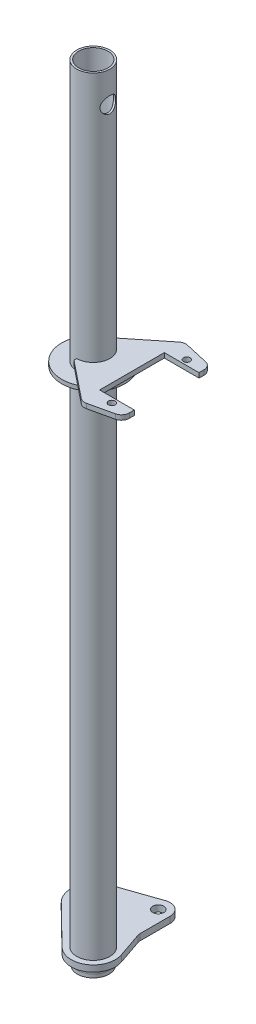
ISO-10303-21;
HEADER;
FILE_DESCRIPTION(('STEP AP214'),'2;1');
FILE_NAME('part.step','',(''),(''),'','','');
FILE_SCHEMA(('AUTOMOTIVE_DESIGN { 1 0 10303 214 1 1 1 1 }'));
ENDSEC;
DATA;
#1=APPLICATION_CONTEXT('core data for automotive mechanical design processes');
#2=APPLICATION_PROTOCOL_DEFINITION('international standard','automotive_design',2000,#1);
#3=PRODUCT_CONTEXT('',#1,'mechanical');
#4=PRODUCT('Part','Part','',(#3));
#5=PRODUCT_RELATED_PRODUCT_CATEGORY('part','',(#4));
#6=PRODUCT_DEFINITION_FORMATION('','',#4);
#7=PRODUCT_DEFINITION_CONTEXT('part definition',#1,'design');
#8=PRODUCT_DEFINITION('design','',#6,#7);
#9=PRODUCT_DEFINITION_SHAPE('','',#8);
#10=(LENGTH_UNIT() NAMED_UNIT(*) SI_UNIT(.MILLI.,.METRE.));
#11=(NAMED_UNIT(*) PLANE_ANGLE_UNIT() SI_UNIT($,.RADIAN.));
#12=(NAMED_UNIT(*) SI_UNIT($,.STERADIAN.) SOLID_ANGLE_UNIT());
#13=UNCERTAINTY_MEASURE_WITH_UNIT(LENGTH_MEASURE(1.E-05),#10,'distance_accuracy_value','');
#14=(GEOMETRIC_REPRESENTATION_CONTEXT(3) GLOBAL_UNCERTAINTY_ASSIGNED_CONTEXT((#13)) GLOBAL_UNIT_ASSIGNED_CONTEXT((#10,
#11,#12)) REPRESENTATION_CONTEXT('',''));
#15=CARTESIAN_POINT('',(0.,0.,0.));
#16=DIRECTION('',(0.,0.,1.));
#17=DIRECTION('',(1.,0.,0.));
#18=AXIS2_PLACEMENT_3D('',#15,#16,#17);
#19=CARTESIAN_POINT('',(0.,-12.,0.));
#20=DIRECTION('',(0.,1.,0.));
#21=DIRECTION('',(0.,0.,1.));
#22=AXIS2_PLACEMENT_3D('',#19,#20,#21);
#23=CYLINDRICAL_SURFACE('',#22,20.);
#24=CARTESIAN_POINT('',(0.,-12.,0.));
#25=DIRECTION('',(0.,-1.,0.));
#26=DIRECTION('',(0.,0.,-1.));
#27=AXIS2_PLACEMENT_3D('',#24,#25,#26);
#28=CIRCLE('',#27,20.);
#29=CARTESIAN_POINT('',(0.,-12.,-20.));
#30=VERTEX_POINT('',#29);
#31=EDGE_CURVE('E11',#30,#30,#28,.T.);
#32=ORIENTED_EDGE('',*,*,#31,.F.);
#33=EDGE_LOOP('',(#32));
#34=FACE_BOUND('',#33,.T.);
#35=CARTESIAN_POINT('',(0.,-7.,0.));
#36=DIRECTION('',(0.,-1.,0.));
#37=DIRECTION('',(0.,0.,-1.));
#38=AXIS2_PLACEMENT_3D('',#35,#36,#37);
#39=CIRCLE('',#38,20.);
#40=CARTESIAN_POINT('',(0.,-7.,-20.));
#41=VERTEX_POINT('',#40);
#42=EDGE_CURVE('E49',#41,#41,#39,.T.);
#43=ORIENTED_EDGE('',*,*,#42,.T.);
#44=EDGE_LOOP('',(#43));
#45=FACE_BOUND('',#44,.T.);
#46=ADVANCED_FACE('F43',(#34,#45),#23,.T.);
#47=CARTESIAN_POINT('',(0.,-12.,0.));
#48=DIRECTION('',(0.,-1.,0.));
#49=DIRECTION('',(0.,0.,-1.));
#50=AXIS2_PLACEMENT_3D('',#47,#48,#49);
#51=PLANE('',#50);
#52=ORIENTED_EDGE('',*,*,#31,.T.);
#53=EDGE_LOOP('',(#52));
#54=FACE_BOUND('',#53,.T.);
#55=ADVANCED_FACE('F58',(#54),#51,.T.);
#56=CARTESIAN_POINT('',(0.,-7.,0.));
#57=DIRECTION('',(0.,-1.,0.));
#58=DIRECTION('',(0.,0.,-1.));
#59=AXIS2_PLACEMENT_3D('',#56,#57,#58);
#60=PLANE('',#59);
#61=ORIENTED_EDGE('',*,*,#42,.F.);
#62=EDGE_LOOP('',(#61));
#63=FACE_BOUND('',#62,.T.);
#64=ADVANCED_FACE('F56',(#63),#60,.F.);
#65=CLOSED_SHELL('',(#46,#55,#64));
#66=MANIFOLD_SOLID_BREP('B2',#65);
#67=CARTESIAN_POINT('',(83.,658.3,47.3732157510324));
#68=DIRECTION('',(0.,1.,0.));
#69=DIRECTION('',(-1.,0.,0.));
#70=AXIS2_PLACEMENT_3D('',#67,#68,#69);
#71=PLANE('',#70);
#72=CARTESIAN_POINT('',(71.,658.3,47.5));
#73=DIRECTION('',(0.,-1.,0.));
#74=DIRECTION('',(1.,0.,0.));
#75=AXIS2_PLACEMENT_3D('',#72,#73,#74);
#76=CIRCLE('',#75,4.2);
#77=CARTESIAN_POINT('',(75.2,658.3,47.5));
#78=VERTEX_POINT('',#77);
#79=EDGE_CURVE('E235',#78,#78,#76,.T.);
#80=ORIENTED_EDGE('',*,*,#79,.F.);
#81=EDGE_LOOP('',(#80));
#82=FACE_BOUND('',#81,.T.);
#83=DIRECTION('',(1.,0.,0.));
#84=VECTOR('',#83,1.);
#85=CARTESIAN_POINT('',(49.,658.3,41.));
#86=LINE('',#85,#84);
#87=CARTESIAN_POINT('',(49.,658.3,41.));
#88=VERTEX_POINT('',#87);
#89=CARTESIAN_POINT('',(93.,658.3,41.));
#90=VERTEX_POINT('',#89);
#91=EDGE_CURVE('E273',#88,#90,#86,.T.);
#92=ORIENTED_EDGE('',*,*,#91,.T.);
#93=DIRECTION('',(0.,0.,1.));
#94=VECTOR('',#93,1.);
#95=CARTESIAN_POINT('',(93.,658.3,41.));
#96=LINE('',#95,#94);
#97=CARTESIAN_POINT('',(93.,658.3,47.3732157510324));
#98=VERTEX_POINT('',#97);
#99=EDGE_CURVE('E230',#90,#98,#96,.T.);
#100=ORIENTED_EDGE('',*,*,#99,.T.);
#101=CARTESIAN_POINT('',(83.,658.3,47.3732157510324));
#102=DIRECTION('',(0.,-1.,0.));
#103=DIRECTION('',(-1.,0.,0.));
#104=AXIS2_PLACEMENT_3D('',#101,#102,#103);
#105=CIRCLE('',#104,10.);
#106=CARTESIAN_POINT('',(85.2154849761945,658.3,57.1247092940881));
#107=VERTEX_POINT('',#106);
#108=EDGE_CURVE('E276',#98,#107,#105,.T.);
#109=ORIENTED_EDGE('',*,*,#108,.T.);
#110=DIRECTION('',(-0.975149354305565,0.,0.221548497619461));
#111=VECTOR('',#110,1.);
#112=CARTESIAN_POINT('',(85.2154849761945,658.3,57.1247092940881));
#113=LINE('',#112,#111);
#114=CARTESIAN_POINT('',(55.2558255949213,658.3,63.9313769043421));
#115=VERTEX_POINT('',#114);
#116=EDGE_CURVE('E278',#107,#115,#113,.T.);
#117=ORIENTED_EDGE('',*,*,#116,.T.);
#118=CARTESIAN_POINT('',(53.0403406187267,658.3,54.1798833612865));
#119=DIRECTION('',(0.,-1.,0.));
#120=DIRECTION('',(-1.,0.,0.));
#121=AXIS2_PLACEMENT_3D('',#118,#119,#120);
#122=CIRCLE('',#121,10.);
#123=CARTESIAN_POINT('',(46.7879140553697,658.3,61.9841874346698));
#124=VERTEX_POINT('',#123);
#125=EDGE_CURVE('E280',#115,#124,#122,.T.);
#126=ORIENTED_EDGE('',*,*,#125,.T.);
#127=DIRECTION('',(-0.780430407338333,0.,-0.625242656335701));
#128=VECTOR('',#127,1.);
#129=CARTESIAN_POINT('',(46.7879140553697,658.3,61.9841874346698));
#130=LINE('',#129,#128);
#131=CARTESIAN_POINT('',(1.12427203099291,658.3,25.4007117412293));
#132=VERTEX_POINT('',#131);
#133=EDGE_CURVE('E282',#124,#132,#130,.T.);
#134=ORIENTED_EDGE('',*,*,#133,.T.);
#135=CARTESIAN_POINT('',(3.,658.3,23.0594205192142));
#136=DIRECTION('',(0.,-1.,0.));
#137=DIRECTION('',(1.,0.,0.));
#138=AXIS2_PLACEMENT_3D('',#135,#136,#137);
#139=CIRCLE('',#138,3.);
#140=CARTESIAN_POINT('',(0.,658.3,23.0594205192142));
#141=VERTEX_POINT('',#140);
#142=EDGE_CURVE('E284',#132,#141,#139,.T.);
#143=ORIENTED_EDGE('',*,*,#142,.T.);
#144=DIRECTION('',(0.,0.,-1.));
#145=VECTOR('',#144,1.);
#146=CARTESIAN_POINT('',(0.,658.3,23.0594205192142));
#147=LINE('',#146,#145);
#148=CARTESIAN_POINT('',(0.,658.3,21.));
#149=VERTEX_POINT('',#148);
#150=EDGE_CURVE('E286',#141,#149,#147,.T.);
#151=ORIENTED_EDGE('',*,*,#150,.T.);
#152=CARTESIAN_POINT('',(0.,658.3,0.));
#153=DIRECTION('',(0.,1.,0.));
#154=DIRECTION('',(-1.,0.,0.));
#155=AXIS2_PLACEMENT_3D('',#152,#153,#154);
#156=CIRCLE('',#155,21.);
#157=CARTESIAN_POINT('',(0.,658.3,-21.));
#158=VERTEX_POINT('',#157);
#159=EDGE_CURVE('E288',#149,#158,#156,.T.);
#160=ORIENTED_EDGE('',*,*,#159,.T.);
#161=DIRECTION('',(0.,0.,-1.));
#162=VECTOR('',#161,1.);
#163=CARTESIAN_POINT('',(0.,658.3,-23.0594205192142));
#164=LINE('',#163,#162);
#165=CARTESIAN_POINT('',(0.,658.3,-23.0594205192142));
#166=VERTEX_POINT('',#165);
#167=EDGE_CURVE('E290',#158,#166,#164,.T.);
#168=ORIENTED_EDGE('',*,*,#167,.T.);
#169=CARTESIAN_POINT('',(3.,658.3,-23.0594205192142));
#170=DIRECTION('',(0.,-1.,0.));
#171=DIRECTION('',(-1.,0.,0.));
#172=AXIS2_PLACEMENT_3D('',#169,#170,#171);
#173=CIRCLE('',#172,3.);
#174=CARTESIAN_POINT('',(1.12427203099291,658.3,-25.4007117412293));
#175=VERTEX_POINT('',#174);
#176=EDGE_CURVE('E292',#166,#175,#173,.T.);
#177=ORIENTED_EDGE('',*,*,#176,.T.);
#178=DIRECTION('',(0.780430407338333,0.,-0.625242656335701));
#179=VECTOR('',#178,1.);
#180=CARTESIAN_POINT('',(46.7879140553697,658.3,-61.9841874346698));
#181=LINE('',#180,#179);
#182=CARTESIAN_POINT('',(46.7879140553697,658.3,-61.9841874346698));
#183=VERTEX_POINT('',#182);
#184=EDGE_CURVE('E294',#175,#183,#181,.T.);
#185=ORIENTED_EDGE('',*,*,#184,.T.);
#186=CARTESIAN_POINT('',(53.0403406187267,658.3,-54.1798833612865));
#187=DIRECTION('',(0.,-1.,0.));
#188=DIRECTION('',(1.,0.,0.));
#189=AXIS2_PLACEMENT_3D('',#186,#187,#188);
#190=CIRCLE('',#189,10.);
#191=CARTESIAN_POINT('',(55.2558255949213,658.3,-63.9313769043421));
#192=VERTEX_POINT('',#191);
#193=EDGE_CURVE('E296',#183,#192,#190,.T.);
#194=ORIENTED_EDGE('',*,*,#193,.T.);
#195=DIRECTION('',(0.975149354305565,0.,0.221548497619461));
#196=VECTOR('',#195,1.);
#197=CARTESIAN_POINT('',(85.2154849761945,658.3,-57.1247092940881));
#198=LINE('',#197,#196);
#199=CARTESIAN_POINT('',(85.2154849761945,658.3,-57.1247092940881));
#200=VERTEX_POINT('',#199);
#201=EDGE_CURVE('E298',#192,#200,#198,.T.);
#202=ORIENTED_EDGE('',*,*,#201,.T.);
#203=CARTESIAN_POINT('',(83.,658.3,-47.3732157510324));
#204=DIRECTION('',(0.,-1.,0.));
#205=DIRECTION('',(1.,0.,0.));
#206=AXIS2_PLACEMENT_3D('',#203,#204,#205);
#207=CIRCLE('',#206,10.);
#208=CARTESIAN_POINT('',(93.,658.3,-47.3732157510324));
#209=VERTEX_POINT('',#208);
#210=EDGE_CURVE('E300',#200,#209,#207,.T.);
#211=ORIENTED_EDGE('',*,*,#210,.T.);
#212=DIRECTION('',(0.,0.,1.));
#213=VECTOR('',#212,1.);
#214=CARTESIAN_POINT('',(93.,658.3,-41.));
#215=LINE('',#214,#213);
#216=CARTESIAN_POINT('',(93.,658.3,-41.));
#217=VERTEX_POINT('',#216);
#218=EDGE_CURVE('E302',#209,#217,#215,.T.);
#219=ORIENTED_EDGE('',*,*,#218,.T.);
#220=DIRECTION('',(-1.,0.,0.));
#221=VECTOR('',#220,1.);
#222=CARTESIAN_POINT('',(49.,658.3,-41.));
#223=LINE('',#222,#221);
#224=CARTESIAN_POINT('',(49.,658.3,-41.));
#225=VERTEX_POINT('',#224);
#226=EDGE_CURVE('E111',#217,#225,#223,.T.);
#227=ORIENTED_EDGE('',*,*,#226,.T.);
#228=DIRECTION('',(0.,0.,1.));
#229=VECTOR('',#228,1.);
#230=CARTESIAN_POINT('',(49.,658.3,-41.));
#231=LINE('',#230,#229);
#232=EDGE_CURVE('E106',#225,#88,#231,.T.);
#233=ORIENTED_EDGE('',*,*,#232,.T.);
#234=EDGE_LOOP('',(#92,#100,#109,#117,#126,#134,#143,#151,#160,#168,#177,#185,#194,#202,#211,
#219,#227,#233));
#235=FACE_BOUND('',#234,.T.);
#236=CARTESIAN_POINT('',(71.,658.3,-47.5));
#237=DIRECTION('',(0.,-1.,0.));
#238=DIRECTION('',(-1.,0.,0.));
#239=AXIS2_PLACEMENT_3D('',#236,#237,#238);
#240=CIRCLE('',#239,4.2);
#241=CARTESIAN_POINT('',(66.8,658.3,-47.5));
#242=VERTEX_POINT('',#241);
#243=EDGE_CURVE('E453',#242,#242,#240,.T.);
#244=ORIENTED_EDGE('',*,*,#243,.F.);
#245=EDGE_LOOP('',(#244));
#246=FACE_BOUND('',#245,.T.);
#247=ADVANCED_FACE('F91',(#82,#235,#246),#71,.F.);
#248=CARTESIAN_POINT('',(83.,664.3,47.3732157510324));
#249=DIRECTION('',(0.,1.,0.));
#250=DIRECTION('',(-1.,0.,0.));
#251=AXIS2_PLACEMENT_3D('',#248,#249,#250);
#252=PLANE('',#251);
#253=CARTESIAN_POINT('',(71.,664.3,47.5));
#254=DIRECTION('',(0.,-1.,0.));
#255=DIRECTION('',(1.,0.,0.));
#256=AXIS2_PLACEMENT_3D('',#253,#254,#255);
#257=CIRCLE('',#256,4.2);
#258=CARTESIAN_POINT('',(75.2,664.3,47.5));
#259=VERTEX_POINT('',#258);
#260=EDGE_CURVE('E238',#259,#259,#257,.T.);
#261=ORIENTED_EDGE('',*,*,#260,.T.);
#262=EDGE_LOOP('',(#261));
#263=FACE_BOUND('',#262,.T.);
#264=DIRECTION('',(1.,0.,0.));
#265=VECTOR('',#264,1.);
#266=CARTESIAN_POINT('',(49.,664.3,41.));
#267=LINE('',#266,#265);
#268=CARTESIAN_POINT('',(49.,664.3,41.));
#269=VERTEX_POINT('',#268);
#270=CARTESIAN_POINT('',(93.,664.3,41.));
#271=VERTEX_POINT('',#270);
#272=EDGE_CURVE('E221',#269,#271,#267,.T.);
#273=ORIENTED_EDGE('',*,*,#272,.F.);
#274=DIRECTION('',(0.,0.,1.));
#275=VECTOR('',#274,1.);
#276=CARTESIAN_POINT('',(49.,664.3,-41.));
#277=LINE('',#276,#275);
#278=CARTESIAN_POINT('',(49.,664.3,-41.));
#279=VERTEX_POINT('',#278);
#280=EDGE_CURVE('E271',#279,#269,#277,.T.);
#281=ORIENTED_EDGE('',*,*,#280,.F.);
#282=DIRECTION('',(-1.,0.,0.));
#283=VECTOR('',#282,1.);
#284=CARTESIAN_POINT('',(49.,664.3,-41.));
#285=LINE('',#284,#283);
#286=CARTESIAN_POINT('',(93.,664.3,-41.));
#287=VERTEX_POINT('',#286);
#288=EDGE_CURVE('E269',#287,#279,#285,.T.);
#289=ORIENTED_EDGE('',*,*,#288,.F.);
#290=DIRECTION('',(0.,0.,1.));
#291=VECTOR('',#290,1.);
#292=CARTESIAN_POINT('',(93.,664.3,-41.));
#293=LINE('',#292,#291);
#294=CARTESIAN_POINT('',(93.,664.3,-47.3732157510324));
#295=VERTEX_POINT('',#294);
#296=EDGE_CURVE('E267',#295,#287,#293,.T.);
#297=ORIENTED_EDGE('',*,*,#296,.F.);
#298=CARTESIAN_POINT('',(83.,664.3,-47.3732157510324));
#299=DIRECTION('',(0.,-1.,0.));
#300=DIRECTION('',(1.,0.,0.));
#301=AXIS2_PLACEMENT_3D('',#298,#299,#300);
#302=CIRCLE('',#301,10.);
#303=CARTESIAN_POINT('',(85.2154849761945,664.3,-57.1247092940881));
#304=VERTEX_POINT('',#303);
#305=EDGE_CURVE('E265',#304,#295,#302,.T.);
#306=ORIENTED_EDGE('',*,*,#305,.F.);
#307=DIRECTION('',(0.975149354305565,0.,0.221548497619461));
#308=VECTOR('',#307,1.);
#309=CARTESIAN_POINT('',(85.2154849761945,664.3,-57.1247092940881));
#310=LINE('',#309,#308);
#311=CARTESIAN_POINT('',(55.2558255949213,664.3,-63.9313769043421));
#312=VERTEX_POINT('',#311);
#313=EDGE_CURVE('E263',#312,#304,#310,.T.);
#314=ORIENTED_EDGE('',*,*,#313,.F.);
#315=CARTESIAN_POINT('',(53.0403406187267,664.3,-54.1798833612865));
#316=DIRECTION('',(0.,-1.,0.));
#317=DIRECTION('',(1.,0.,0.));
#318=AXIS2_PLACEMENT_3D('',#315,#316,#317);
#319=CIRCLE('',#318,10.);
#320=CARTESIAN_POINT('',(46.7879140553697,664.3,-61.9841874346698));
#321=VERTEX_POINT('',#320);
#322=EDGE_CURVE('E261',#321,#312,#319,.T.);
#323=ORIENTED_EDGE('',*,*,#322,.F.);
#324=DIRECTION('',(0.780430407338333,0.,-0.625242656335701));
#325=VECTOR('',#324,1.);
#326=CARTESIAN_POINT('',(46.7879140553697,664.3,-61.9841874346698));
#327=LINE('',#326,#325);
#328=CARTESIAN_POINT('',(1.12427203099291,664.3,-25.4007117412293));
#329=VERTEX_POINT('',#328);
#330=EDGE_CURVE('E259',#329,#321,#327,.T.);
#331=ORIENTED_EDGE('',*,*,#330,.F.);
#332=CARTESIAN_POINT('',(3.,664.3,-23.0594205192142));
#333=DIRECTION('',(0.,-1.,0.));
#334=DIRECTION('',(-1.,0.,0.));
#335=AXIS2_PLACEMENT_3D('',#332,#333,#334);
#336=CIRCLE('',#335,3.);
#337=CARTESIAN_POINT('',(0.,664.3,-23.0594205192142));
#338=VERTEX_POINT('',#337);
#339=EDGE_CURVE('E257',#338,#329,#336,.T.);
#340=ORIENTED_EDGE('',*,*,#339,.F.);
#341=DIRECTION('',(0.,0.,-1.));
#342=VECTOR('',#341,1.);
#343=CARTESIAN_POINT('',(0.,664.3,-23.0594205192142));
#344=LINE('',#343,#342);
#345=CARTESIAN_POINT('',(0.,664.3,-21.));
#346=VERTEX_POINT('',#345);
#347=EDGE_CURVE('E255',#346,#338,#344,.T.);
#348=ORIENTED_EDGE('',*,*,#347,.F.);
#349=CARTESIAN_POINT('',(0.,664.3,0.));
#350=DIRECTION('',(0.,1.,0.));
#351=DIRECTION('',(-1.,0.,0.));
#352=AXIS2_PLACEMENT_3D('',#349,#350,#351);
#353=CIRCLE('',#352,21.);
#354=CARTESIAN_POINT('',(0.,664.3,21.));
#355=VERTEX_POINT('',#354);
#356=EDGE_CURVE('E253',#355,#346,#353,.T.);
#357=ORIENTED_EDGE('',*,*,#356,.F.);
#358=DIRECTION('',(0.,0.,-1.));
#359=VECTOR('',#358,1.);
#360=CARTESIAN_POINT('',(0.,664.3,23.0594205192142));
#361=LINE('',#360,#359);
#362=CARTESIAN_POINT('',(0.,664.3,23.0594205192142));
#363=VERTEX_POINT('',#362);
#364=EDGE_CURVE('E251',#363,#355,#361,.T.);
#365=ORIENTED_EDGE('',*,*,#364,.F.);
#366=CARTESIAN_POINT('',(3.,664.3,23.0594205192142));
#367=DIRECTION('',(0.,-1.,0.));
#368=DIRECTION('',(1.,0.,0.));
#369=AXIS2_PLACEMENT_3D('',#366,#367,#368);
#370=CIRCLE('',#369,3.);
#371=CARTESIAN_POINT('',(1.12427203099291,664.3,25.4007117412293));
#372=VERTEX_POINT('',#371);
#373=EDGE_CURVE('E249',#372,#363,#370,.T.);
#374=ORIENTED_EDGE('',*,*,#373,.F.);
#375=DIRECTION('',(-0.780430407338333,0.,-0.625242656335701));
#376=VECTOR('',#375,1.);
#377=CARTESIAN_POINT('',(46.7879140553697,664.3,61.9841874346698));
#378=LINE('',#377,#376);
#379=CARTESIAN_POINT('',(46.7879140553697,664.3,61.9841874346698));
#380=VERTEX_POINT('',#379);
#381=EDGE_CURVE('E247',#380,#372,#378,.T.);
#382=ORIENTED_EDGE('',*,*,#381,.F.);
#383=CARTESIAN_POINT('',(53.0403406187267,664.3,54.1798833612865));
#384=DIRECTION('',(0.,-1.,0.));
#385=DIRECTION('',(-1.,0.,0.));
#386=AXIS2_PLACEMENT_3D('',#383,#384,#385);
#387=CIRCLE('',#386,10.);
#388=CARTESIAN_POINT('',(55.2558255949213,664.3,63.9313769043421));
#389=VERTEX_POINT('',#388);
#390=EDGE_CURVE('E245',#389,#380,#387,.T.);
#391=ORIENTED_EDGE('',*,*,#390,.F.);
#392=DIRECTION('',(-0.975149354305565,0.,0.221548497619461));
#393=VECTOR('',#392,1.);
#394=CARTESIAN_POINT('',(85.2154849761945,664.3,57.1247092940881));
#395=LINE('',#394,#393);
#396=CARTESIAN_POINT('',(85.2154849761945,664.3,57.1247092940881));
#397=VERTEX_POINT('',#396);
#398=EDGE_CURVE('E243',#397,#389,#395,.T.);
#399=ORIENTED_EDGE('',*,*,#398,.F.);
#400=CARTESIAN_POINT('',(83.,664.3,47.3732157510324));
#401=DIRECTION('',(0.,-1.,0.));
#402=DIRECTION('',(-1.,0.,0.));
#403=AXIS2_PLACEMENT_3D('',#400,#401,#402);
#404=CIRCLE('',#403,10.);
#405=CARTESIAN_POINT('',(93.,664.3,47.3732157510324));
#406=VERTEX_POINT('',#405);
#407=EDGE_CURVE('E223',#406,#397,#404,.T.);
#408=ORIENTED_EDGE('',*,*,#407,.F.);
#409=DIRECTION('',(0.,0.,1.));
#410=VECTOR('',#409,1.);
#411=CARTESIAN_POINT('',(93.,664.3,41.));
#412=LINE('',#411,#410);
#413=EDGE_CURVE('E216',#271,#406,#412,.T.);
#414=ORIENTED_EDGE('',*,*,#413,.F.);
#415=EDGE_LOOP('',(#273,#281,#289,#297,#306,#314,#323,#331,#340,#348,#357,#365,#374,#382,#391,
#399,#408,#414));
#416=FACE_BOUND('',#415,.T.);
#417=CARTESIAN_POINT('',(71.,664.3,-47.5));
#418=DIRECTION('',(0.,-1.,0.));
#419=DIRECTION('',(-1.,0.,0.));
#420=AXIS2_PLACEMENT_3D('',#417,#418,#419);
#421=CIRCLE('',#420,4.2);
#422=CARTESIAN_POINT('',(66.8,664.3,-47.5));
#423=VERTEX_POINT('',#422);
#424=EDGE_CURVE('E456',#423,#423,#421,.T.);
#425=ORIENTED_EDGE('',*,*,#424,.T.);
#426=EDGE_LOOP('',(#425));
#427=FACE_BOUND('',#426,.T.);
#428=ADVANCED_FACE('F217',(#263,#416,#427),#252,.T.);
#429=CARTESIAN_POINT('',(49.,658.3,41.));
#430=DIRECTION('',(0.,0.,1.));
#431=DIRECTION('',(-1.,0.,0.));
#432=AXIS2_PLACEMENT_3D('',#429,#430,#431);
#433=PLANE('',#432);
#434=ORIENTED_EDGE('',*,*,#272,.T.);
#435=DIRECTION('',(0.,1.,0.));
#436=VECTOR('',#435,1.);
#437=CARTESIAN_POINT('',(93.,658.3,41.));
#438=LINE('',#437,#436);
#439=EDGE_CURVE('E41',#90,#271,#438,.T.);
#440=ORIENTED_EDGE('',*,*,#439,.F.);
#441=ORIENTED_EDGE('',*,*,#91,.F.);
#442=DIRECTION('',(0.,1.,0.));
#443=VECTOR('',#442,1.);
#444=CARTESIAN_POINT('',(49.,658.3,41.));
#445=LINE('',#444,#443);
#446=EDGE_CURVE('E234',#88,#269,#445,.T.);
#447=ORIENTED_EDGE('',*,*,#446,.T.);
#448=EDGE_LOOP('',(#434,#440,#441,#447));
#449=FACE_BOUND('',#448,.T.);
#450=ADVANCED_FACE('F93',(#449),#433,.F.);
#451=CARTESIAN_POINT('',(93.,658.3,41.));
#452=DIRECTION('',(-1.,0.,0.));
#453=DIRECTION('',(0.,-1.,0.));
#454=AXIS2_PLACEMENT_3D('',#451,#452,#453);
#455=PLANE('',#454);
#456=ORIENTED_EDGE('',*,*,#413,.T.);
#457=DIRECTION('',(0.,1.,0.));
#458=VECTOR('',#457,1.);
#459=CARTESIAN_POINT('',(93.,658.3,47.3732157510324));
#460=LINE('',#459,#458);
#461=EDGE_CURVE('E99',#98,#406,#460,.T.);
#462=ORIENTED_EDGE('',*,*,#461,.F.);
#463=ORIENTED_EDGE('',*,*,#99,.F.);
#464=ORIENTED_EDGE('',*,*,#439,.T.);
#465=EDGE_LOOP('',(#456,#462,#463,#464));
#466=FACE_BOUND('',#465,.T.);
#467=ADVANCED_FACE('F229',(#466),#455,.F.);
#468=CARTESIAN_POINT('',(83.,658.3,47.3732157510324));
#469=DIRECTION('',(0.,1.,0.));
#470=DIRECTION('',(-1.,0.,0.));
#471=AXIS2_PLACEMENT_3D('',#468,#469,#470);
#472=CYLINDRICAL_SURFACE('',#471,10.);
#473=ORIENTED_EDGE('',*,*,#407,.T.);
#474=DIRECTION('',(0.,1.,0.));
#475=VECTOR('',#474,1.);
#476=CARTESIAN_POINT('',(85.2154849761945,658.3,57.1247092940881));
#477=LINE('',#476,#475);
#478=EDGE_CURVE('E349',#107,#397,#477,.T.);
#479=ORIENTED_EDGE('',*,*,#478,.F.);
#480=ORIENTED_EDGE('',*,*,#108,.F.);
#481=ORIENTED_EDGE('',*,*,#461,.T.);
#482=EDGE_LOOP('',(#473,#479,#480,#481));
#483=FACE_BOUND('',#482,.T.);
#484=ADVANCED_FACE('F353',(#483),#472,.T.);
#485=CARTESIAN_POINT('',(85.2154849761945,658.3,57.1247092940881));
#486=DIRECTION('',(-0.221548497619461,0.,-0.975149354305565));
#487=DIRECTION('',(0.975149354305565,0.,-0.221548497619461));
#488=AXIS2_PLACEMENT_3D('',#485,#486,#487);
#489=PLANE('',#488);
#490=ORIENTED_EDGE('',*,*,#398,.T.);
#491=DIRECTION('',(0.,1.,0.));
#492=VECTOR('',#491,1.);
#493=CARTESIAN_POINT('',(55.2558255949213,658.3,63.9313769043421));
#494=LINE('',#493,#492);
#495=EDGE_CURVE('E346',#115,#389,#494,.T.);
#496=ORIENTED_EDGE('',*,*,#495,.F.);
#497=ORIENTED_EDGE('',*,*,#116,.F.);
#498=ORIENTED_EDGE('',*,*,#478,.T.);
#499=EDGE_LOOP('',(#490,#496,#497,#498));
#500=FACE_BOUND('',#499,.T.);
#501=ADVANCED_FACE('F361',(#500),#489,.F.);
#502=CARTESIAN_POINT('',(53.0403406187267,658.3,54.1798833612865));
#503=DIRECTION('',(0.,1.,0.));
#504=DIRECTION('',(-1.,0.,0.));
#505=AXIS2_PLACEMENT_3D('',#502,#503,#504);
#506=CYLINDRICAL_SURFACE('',#505,10.);
#507=ORIENTED_EDGE('',*,*,#390,.T.);
#508=DIRECTION('',(0.,1.,0.));
#509=VECTOR('',#508,1.);
#510=CARTESIAN_POINT('',(46.7879140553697,658.3,61.9841874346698));
#511=LINE('',#510,#509);
#512=EDGE_CURVE('E343',#124,#380,#511,.T.);
#513=ORIENTED_EDGE('',*,*,#512,.F.);
#514=ORIENTED_EDGE('',*,*,#125,.F.);
#515=ORIENTED_EDGE('',*,*,#495,.T.);
#516=EDGE_LOOP('',(#507,#513,#514,#515));
#517=FACE_BOUND('',#516,.T.);
#518=ADVANCED_FACE('F364',(#517),#506,.T.);
#519=CARTESIAN_POINT('',(46.7879140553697,658.3,61.9841874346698));
#520=DIRECTION('',(0.625242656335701,0.,-0.780430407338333));
#521=DIRECTION('',(0.780430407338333,0.,0.625242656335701));
#522=AXIS2_PLACEMENT_3D('',#519,#520,#521);
#523=PLANE('',#522);
#524=ORIENTED_EDGE('',*,*,#381,.T.);
#525=DIRECTION('',(0.,1.,0.));
#526=VECTOR('',#525,1.);
#527=CARTESIAN_POINT('',(1.12427203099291,658.3,25.4007117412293));
#528=LINE('',#527,#526);
#529=EDGE_CURVE('E340',#132,#372,#528,.T.);
#530=ORIENTED_EDGE('',*,*,#529,.F.);
#531=ORIENTED_EDGE('',*,*,#133,.F.);
#532=ORIENTED_EDGE('',*,*,#512,.T.);
#533=EDGE_LOOP('',(#524,#530,#531,#532));
#534=FACE_BOUND('',#533,.T.);
#535=ADVANCED_FACE('F369',(#534),#523,.F.);
#536=CARTESIAN_POINT('',(3.,658.3,23.0594205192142));
#537=DIRECTION('',(0.,1.,0.));
#538=DIRECTION('',(-1.,0.,0.));
#539=AXIS2_PLACEMENT_3D('',#536,#537,#538);
#540=CYLINDRICAL_SURFACE('',#539,3.);
#541=ORIENTED_EDGE('',*,*,#373,.T.);
#542=DIRECTION('',(0.,1.,0.));
#543=VECTOR('',#542,1.);
#544=CARTESIAN_POINT('',(0.,658.3,23.0594205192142));
#545=LINE('',#544,#543);
#546=EDGE_CURVE('E337',#141,#363,#545,.T.);
#547=ORIENTED_EDGE('',*,*,#546,.F.);
#548=ORIENTED_EDGE('',*,*,#142,.F.);
#549=ORIENTED_EDGE('',*,*,#529,.T.);
#550=EDGE_LOOP('',(#541,#547,#548,#549));
#551=FACE_BOUND('',#550,.T.);
#552=ADVANCED_FACE('F375',(#551),#540,.T.);
#553=CARTESIAN_POINT('',(0.,658.3,23.0594205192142));
#554=DIRECTION('',(1.,0.,0.));
#555=DIRECTION('',(0.,0.,1.));
#556=AXIS2_PLACEMENT_3D('',#553,#554,#555);
#557=PLANE('',#556);
#558=ORIENTED_EDGE('',*,*,#364,.T.);
#559=DIRECTION('',(0.,1.,0.));
#560=VECTOR('',#559,1.);
#561=CARTESIAN_POINT('',(0.,658.3,21.));
#562=LINE('',#561,#560);
#563=EDGE_CURVE('E334',#149,#355,#562,.T.);
#564=ORIENTED_EDGE('',*,*,#563,.F.);
#565=ORIENTED_EDGE('',*,*,#150,.F.);
#566=ORIENTED_EDGE('',*,*,#546,.T.);
#567=EDGE_LOOP('',(#558,#564,#565,#566));
#568=FACE_BOUND('',#567,.T.);
#569=ADVANCED_FACE('F379',(#568),#557,.F.);
#570=CARTESIAN_POINT('',(0.,658.3,0.));
#571=DIRECTION('',(0.,1.,0.));
#572=DIRECTION('',(-1.,0.,0.));
#573=AXIS2_PLACEMENT_3D('',#570,#571,#572);
#574=CYLINDRICAL_SURFACE('',#573,21.);
#575=ORIENTED_EDGE('',*,*,#356,.T.);
#576=DIRECTION('',(0.,1.,0.));
#577=VECTOR('',#576,1.);
#578=CARTESIAN_POINT('',(0.,658.3,-21.));
#579=LINE('',#578,#577);
#580=EDGE_CURVE('E331',#158,#346,#579,.T.);
#581=ORIENTED_EDGE('',*,*,#580,.F.);
#582=ORIENTED_EDGE('',*,*,#159,.F.);
#583=ORIENTED_EDGE('',*,*,#563,.T.);
#584=EDGE_LOOP('',(#575,#581,#582,#583));
#585=FACE_BOUND('',#584,.T.);
#586=ADVANCED_FACE('F384',(#585),#574,.F.);
#587=CARTESIAN_POINT('',(0.,658.3,-23.0594205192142));
#588=DIRECTION('',(1.,0.,0.));
#589=DIRECTION('',(0.,0.,1.));
#590=AXIS2_PLACEMENT_3D('',#587,#588,#589);
#591=PLANE('',#590);
#592=ORIENTED_EDGE('',*,*,#347,.T.);
#593=DIRECTION('',(0.,1.,0.));
#594=VECTOR('',#593,1.);
#595=CARTESIAN_POINT('',(0.,658.3,-23.0594205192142));
#596=LINE('',#595,#594);
#597=EDGE_CURVE('E328',#166,#338,#596,.T.);
#598=ORIENTED_EDGE('',*,*,#597,.F.);
#599=ORIENTED_EDGE('',*,*,#167,.F.);
#600=ORIENTED_EDGE('',*,*,#580,.T.);
#601=EDGE_LOOP('',(#592,#598,#599,#600));
#602=FACE_BOUND('',#601,.T.);
#603=ADVANCED_FACE('F390',(#602),#591,.F.);
#604=CARTESIAN_POINT('',(3.,658.3,-23.0594205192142));
#605=DIRECTION('',(0.,1.,0.));
#606=DIRECTION('',(-1.,0.,0.));
#607=AXIS2_PLACEMENT_3D('',#604,#605,#606);
#608=CYLINDRICAL_SURFACE('',#607,3.);
#609=ORIENTED_EDGE('',*,*,#339,.T.);
#610=DIRECTION('',(0.,1.,0.));
#611=VECTOR('',#610,1.);
#612=CARTESIAN_POINT('',(1.12427203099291,658.3,-25.4007117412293));
#613=LINE('',#612,#611);
#614=EDGE_CURVE('E325',#175,#329,#613,.T.);
#615=ORIENTED_EDGE('',*,*,#614,.F.);
#616=ORIENTED_EDGE('',*,*,#176,.F.);
#617=ORIENTED_EDGE('',*,*,#597,.T.);
#618=EDGE_LOOP('',(#609,#615,#616,#617));
#619=FACE_BOUND('',#618,.T.);
#620=ADVANCED_FACE('F394',(#619),#608,.T.);
#621=CARTESIAN_POINT('',(46.7879140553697,658.3,-61.9841874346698));
#622=DIRECTION('',(0.625242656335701,0.,0.780430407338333));
#623=DIRECTION('',(-0.780430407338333,0.,0.625242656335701));
#624=AXIS2_PLACEMENT_3D('',#621,#622,#623);
#625=PLANE('',#624);
#626=ORIENTED_EDGE('',*,*,#330,.T.);
#627=DIRECTION('',(0.,1.,0.));
#628=VECTOR('',#627,1.);
#629=CARTESIAN_POINT('',(46.7879140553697,658.3,-61.9841874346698));
#630=LINE('',#629,#628);
#631=EDGE_CURVE('E322',#183,#321,#630,.T.);
#632=ORIENTED_EDGE('',*,*,#631,.F.);
#633=ORIENTED_EDGE('',*,*,#184,.F.);
#634=ORIENTED_EDGE('',*,*,#614,.T.);
#635=EDGE_LOOP('',(#626,#632,#633,#634));
#636=FACE_BOUND('',#635,.T.);
#637=ADVANCED_FACE('F399',(#636),#625,.F.);
#638=CARTESIAN_POINT('',(53.0403406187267,658.3,-54.1798833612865));
#639=DIRECTION('',(0.,1.,0.));
#640=DIRECTION('',(-1.,0.,0.));
#641=AXIS2_PLACEMENT_3D('',#638,#639,#640);
#642=CYLINDRICAL_SURFACE('',#641,10.);
#643=ORIENTED_EDGE('',*,*,#322,.T.);
#644=DIRECTION('',(0.,1.,0.));
#645=VECTOR('',#644,1.);
#646=CARTESIAN_POINT('',(55.2558255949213,658.3,-63.9313769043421));
#647=LINE('',#646,#645);
#648=EDGE_CURVE('E319',#192,#312,#647,.T.);
#649=ORIENTED_EDGE('',*,*,#648,.F.);
#650=ORIENTED_EDGE('',*,*,#193,.F.);
#651=ORIENTED_EDGE('',*,*,#631,.T.);
#652=EDGE_LOOP('',(#643,#649,#650,#651));
#653=FACE_BOUND('',#652,.T.);
#654=ADVANCED_FACE('F405',(#653),#642,.T.);
#655=CARTESIAN_POINT('',(85.2154849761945,658.3,-57.1247092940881));
#656=DIRECTION('',(-0.221548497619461,0.,0.975149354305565));
#657=DIRECTION('',(-0.975149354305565,0.,-0.221548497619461));
#658=AXIS2_PLACEMENT_3D('',#655,#656,#657);
#659=PLANE('',#658);
#660=ORIENTED_EDGE('',*,*,#313,.T.);
#661=DIRECTION('',(0.,1.,0.));
#662=VECTOR('',#661,1.);
#663=CARTESIAN_POINT('',(85.2154849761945,658.3,-57.1247092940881));
#664=LINE('',#663,#662);
#665=EDGE_CURVE('E316',#200,#304,#664,.T.);
#666=ORIENTED_EDGE('',*,*,#665,.F.);
#667=ORIENTED_EDGE('',*,*,#201,.F.);
#668=ORIENTED_EDGE('',*,*,#648,.T.);
#669=EDGE_LOOP('',(#660,#666,#667,#668));
#670=FACE_BOUND('',#669,.T.);
#671=ADVANCED_FACE('F409',(#670),#659,.F.);
#672=CARTESIAN_POINT('',(83.,658.3,-47.3732157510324));
#673=DIRECTION('',(0.,1.,0.));
#674=DIRECTION('',(-1.,0.,0.));
#675=AXIS2_PLACEMENT_3D('',#672,#673,#674);
#676=CYLINDRICAL_SURFACE('',#675,10.);
#677=ORIENTED_EDGE('',*,*,#305,.T.);
#678=DIRECTION('',(0.,1.,0.));
#679=VECTOR('',#678,1.);
#680=CARTESIAN_POINT('',(93.,658.3,-47.3732157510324));
#681=LINE('',#680,#679);
#682=EDGE_CURVE('E313',#209,#295,#681,.T.);
#683=ORIENTED_EDGE('',*,*,#682,.F.);
#684=ORIENTED_EDGE('',*,*,#210,.F.);
#685=ORIENTED_EDGE('',*,*,#665,.T.);
#686=EDGE_LOOP('',(#677,#683,#684,#685));
#687=FACE_BOUND('',#686,.T.);
#688=ADVANCED_FACE('F414',(#687),#676,.T.);
#689=CARTESIAN_POINT('',(93.,658.3,-41.));
#690=DIRECTION('',(-1.,0.,0.));
#691=DIRECTION('',(0.,-1.,0.));
#692=AXIS2_PLACEMENT_3D('',#689,#690,#691);
#693=PLANE('',#692);
#694=ORIENTED_EDGE('',*,*,#296,.T.);
#695=DIRECTION('',(0.,1.,0.));
#696=VECTOR('',#695,1.);
#697=CARTESIAN_POINT('',(93.,658.3,-41.));
#698=LINE('',#697,#696);
#699=EDGE_CURVE('E310',#217,#287,#698,.T.);
#700=ORIENTED_EDGE('',*,*,#699,.F.);
#701=ORIENTED_EDGE('',*,*,#218,.F.);
#702=ORIENTED_EDGE('',*,*,#682,.T.);
#703=EDGE_LOOP('',(#694,#700,#701,#702));
#704=FACE_BOUND('',#703,.T.);
#705=ADVANCED_FACE('F418',(#704),#693,.F.);
#706=CARTESIAN_POINT('',(49.,658.3,-41.));
#707=DIRECTION('',(0.,0.,-1.));
#708=DIRECTION('',(1.,0.,0.));
#709=AXIS2_PLACEMENT_3D('',#706,#707,#708);
#710=PLANE('',#709);
#711=ORIENTED_EDGE('',*,*,#288,.T.);
#712=DIRECTION('',(0.,1.,0.));
#713=VECTOR('',#712,1.);
#714=CARTESIAN_POINT('',(49.,658.3,-41.));
#715=LINE('',#714,#713);
#716=EDGE_CURVE('E307',#225,#279,#715,.T.);
#717=ORIENTED_EDGE('',*,*,#716,.F.);
#718=ORIENTED_EDGE('',*,*,#226,.F.);
#719=ORIENTED_EDGE('',*,*,#699,.T.);
#720=EDGE_LOOP('',(#711,#717,#718,#719));
#721=FACE_BOUND('',#720,.T.);
#722=ADVANCED_FACE('F422',(#721),#710,.F.);
#723=CARTESIAN_POINT('',(49.,658.3,-41.));
#724=DIRECTION('',(-1.,0.,0.));
#725=DIRECTION('',(0.,-1.,0.));
#726=AXIS2_PLACEMENT_3D('',#723,#724,#725);
#727=PLANE('',#726);
#728=ORIENTED_EDGE('',*,*,#280,.T.);
#729=ORIENTED_EDGE('',*,*,#446,.F.);
#730=ORIENTED_EDGE('',*,*,#232,.F.);
#731=ORIENTED_EDGE('',*,*,#716,.T.);
#732=EDGE_LOOP('',(#728,#729,#730,#731));
#733=FACE_BOUND('',#732,.T.);
#734=ADVANCED_FACE('F424',(#733),#727,.F.);
#735=CARTESIAN_POINT('',(71.,658.3,47.5));
#736=DIRECTION('',(0.,1.,0.));
#737=DIRECTION('',(-1.,0.,0.));
#738=AXIS2_PLACEMENT_3D('',#735,#736,#737);
#739=CYLINDRICAL_SURFACE('',#738,4.2);
#740=ORIENTED_EDGE('',*,*,#79,.T.);
#741=EDGE_LOOP('',(#740));
#742=FACE_BOUND('',#741,.T.);
#743=ORIENTED_EDGE('',*,*,#260,.F.);
#744=EDGE_LOOP('',(#743));
#745=FACE_BOUND('',#744,.T.);
#746=ADVANCED_FACE('F426',(#742,#745),#739,.F.);
#747=CARTESIAN_POINT('',(71.,658.3,-47.5));
#748=DIRECTION('',(0.,1.,0.));
#749=DIRECTION('',(-1.,0.,0.));
#750=AXIS2_PLACEMENT_3D('',#747,#748,#749);
#751=CYLINDRICAL_SURFACE('',#750,4.2);
#752=ORIENTED_EDGE('',*,*,#243,.T.);
#753=EDGE_LOOP('',(#752));
#754=FACE_BOUND('',#753,.T.);
#755=ORIENTED_EDGE('',*,*,#424,.F.);
#756=EDGE_LOOP('',(#755));
#757=FACE_BOUND('',#756,.T.);
#758=ADVANCED_FACE('F432',(#754,#757),#751,.F.);
#759=CLOSED_SHELL('',(#247,#428,#450,#467,#484,#501,#518,#535,#552,#569,#586,#603,#620,#637,
#654,#671,#688,#705,#722,#734,#746,#758));
#760=MANIFOLD_SOLID_BREP('B6',#759);
#761=CARTESIAN_POINT('',(-48.1,81.,-49.9));
#762=DIRECTION('',(0.,-1.,0.));
#763=DIRECTION('',(0.,0.,-1.));
#764=AXIS2_PLACEMENT_3D('',#761,#762,#763);
#765=CYLINDRICAL_SURFACE('',#764,15.);
#766=CARTESIAN_POINT('',(-48.1,79.,-49.9));
#767=DIRECTION('',(0.,1.,0.));
#768=DIRECTION('',(0.,0.,1.));
#769=AXIS2_PLACEMENT_3D('',#766,#767,#768);
#770=CIRCLE('',#769,15.);
#771=CARTESIAN_POINT('',(-48.1,79.,-34.9));
#772=VERTEX_POINT('',#771);
#773=EDGE_CURVE('E90',#772,#772,#770,.F.);
#774=ORIENTED_EDGE('',*,*,#773,.T.);
#775=EDGE_LOOP('',(#774));
#776=FACE_BOUND('',#775,.T.);
#777=CARTESIAN_POINT('',(-48.1,-3.,-49.9));
#778=DIRECTION('',(0.,1.,0.));
#779=DIRECTION('',(0.,0.,1.));
#780=AXIS2_PLACEMENT_3D('',#777,#778,#779);
#781=CIRCLE('',#780,15.);
#782=CARTESIAN_POINT('',(-48.1,-3.,-34.9));
#783=VERTEX_POINT('',#782);
#784=EDGE_CURVE('E638',#783,#783,#781,.T.);
#785=ORIENTED_EDGE('',*,*,#784,.T.);
#786=EDGE_LOOP('',(#785));
#787=FACE_BOUND('',#786,.T.);
#788=ADVANCED_FACE('F628',(#776,#787),#765,.T.);
#789=CARTESIAN_POINT('',(-48.1,81.,-49.9));
#790=DIRECTION('',(0.,1.,0.));
#791=DIRECTION('',(0.,0.,1.));
#792=AXIS2_PLACEMENT_3D('',#789,#790,#791);
#793=PLANE('',#792);
#794=CARTESIAN_POINT('',(-48.1,81.,-49.9));
#795=DIRECTION('',(0.,1.,0.));
#796=DIRECTION('',(0.,0.,1.));
#797=AXIS2_PLACEMENT_3D('',#794,#795,#796);
#798=CIRCLE('',#797,13.);
#799=CARTESIAN_POINT('',(-48.1,81.,-36.9));
#800=VERTEX_POINT('',#799);
#801=EDGE_CURVE('E634',#800,#800,#798,.T.);
#802=ORIENTED_EDGE('',*,*,#801,.T.);
#803=EDGE_LOOP('',(#802));
#804=FACE_BOUND('',#803,.T.);
#805=ADVANCED_FACE('F649',(#804),#793,.T.);
#806=CARTESIAN_POINT('',(-48.1,-3.,-49.9));
#807=DIRECTION('',(0.,1.,0.));
#808=DIRECTION('',(0.,0.,1.));
#809=AXIS2_PLACEMENT_3D('',#806,#807,#808);
#810=PLANE('',#809);
#811=ORIENTED_EDGE('',*,*,#784,.F.);
#812=EDGE_LOOP('',(#811));
#813=FACE_BOUND('',#812,.T.);
#814=ADVANCED_FACE('F646',(#813),#810,.F.);
#815=CARTESIAN_POINT('',(-48.1,81.,-49.9));
#816=DIRECTION('',(0.,-1.,0.));
#817=DIRECTION('',(0.,0.,-1.));
#818=AXIS2_PLACEMENT_3D('',#815,#816,#817);
#819=CONICAL_SURFACE('',#818,13.,0.785398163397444);
#820=ORIENTED_EDGE('',*,*,#773,.F.);
#821=EDGE_LOOP('',(#820));
#822=FACE_BOUND('',#821,.T.);
#823=ORIENTED_EDGE('',*,*,#801,.F.);
#824=EDGE_LOOP('',(#823));
#825=FACE_BOUND('',#824,.T.);
#826=ADVANCED_FACE('F648',(#822,#825),#819,.T.);
#827=CLOSED_SHELL('',(#788,#805,#814,#826));
#828=MANIFOLD_SOLID_BREP('B35',#827);
#829=CARTESIAN_POINT('',(0.,651.,0.));
#830=DIRECTION('',(0.,1.,0.));
#831=DIRECTION('',(0.,0.,1.));
#832=AXIS2_PLACEMENT_3D('',#829,#830,#831);
#833=PLANE('',#832);
#834=CARTESIAN_POINT('',(0.,651.,0.));
#835=DIRECTION('',(0.,1.,0.));
#836=DIRECTION('',(0.,0.,1.));
#837=AXIS2_PLACEMENT_3D('',#834,#835,#836);
#838=CIRCLE('',#837,40.);
#839=CARTESIAN_POINT('',(0.,651.,40.));
#840=VERTEX_POINT('',#839);
#841=EDGE_CURVE('E627',#840,#840,#838,.T.);
#842=ORIENTED_EDGE('',*,*,#841,.T.);
#843=EDGE_LOOP('',(#842));
#844=FACE_BOUND('',#843,.T.);
#845=CARTESIAN_POINT('',(0.,651.,0.));
#846=DIRECTION('',(0.,1.,0.));
#847=DIRECTION('',(0.,0.,1.));
#848=AXIS2_PLACEMENT_3D('',#845,#846,#847);
#849=CIRCLE('',#848,21.);
#850=CARTESIAN_POINT('',(0.,651.,21.));
#851=VERTEX_POINT('',#850);
#852=EDGE_CURVE('E708',#851,#851,#849,.T.);
#853=ORIENTED_EDGE('',*,*,#852,.F.);
#854=EDGE_LOOP('',(#853));
#855=FACE_BOUND('',#854,.T.);
#856=ADVANCED_FACE('F697',(#844,#855),#833,.T.);
#857=CARTESIAN_POINT('',(0.,646.,0.));
#858=DIRECTION('',(0.,1.,0.));
#859=DIRECTION('',(0.,0.,1.));
#860=AXIS2_PLACEMENT_3D('',#857,#858,#859);
#861=PLANE('',#860);
#862=CARTESIAN_POINT('',(0.,646.,0.));
#863=DIRECTION('',(0.,1.,0.));
#864=DIRECTION('',(0.,0.,1.));
#865=AXIS2_PLACEMENT_3D('',#862,#863,#864);
#866=CIRCLE('',#865,40.);
#867=CARTESIAN_POINT('',(0.,646.,40.));
#868=VERTEX_POINT('',#867);
#869=EDGE_CURVE('E704',#868,#868,#866,.T.);
#870=ORIENTED_EDGE('',*,*,#869,.F.);
#871=EDGE_LOOP('',(#870));
#872=FACE_BOUND('',#871,.T.);
#873=CARTESIAN_POINT('',(0.,646.,0.));
#874=DIRECTION('',(0.,1.,0.));
#875=DIRECTION('',(0.,0.,1.));
#876=AXIS2_PLACEMENT_3D('',#873,#874,#875);
#877=CIRCLE('',#876,21.);
#878=CARTESIAN_POINT('',(0.,646.,21.));
#879=VERTEX_POINT('',#878);
#880=EDGE_CURVE('E712',#879,#879,#877,.T.);
#881=ORIENTED_EDGE('',*,*,#880,.T.);
#882=EDGE_LOOP('',(#881));
#883=FACE_BOUND('',#882,.T.);
#884=ADVANCED_FACE('F718',(#872,#883),#861,.F.);
#885=CARTESIAN_POINT('',(0.,651.,0.));
#886=DIRECTION('',(0.,-1.,0.));
#887=DIRECTION('',(0.,0.,-1.));
#888=AXIS2_PLACEMENT_3D('',#885,#886,#887);
#889=CYLINDRICAL_SURFACE('',#888,40.);
#890=ORIENTED_EDGE('',*,*,#841,.F.);
#891=EDGE_LOOP('',(#890));
#892=FACE_BOUND('',#891,.T.);
#893=ORIENTED_EDGE('',*,*,#869,.T.);
#894=EDGE_LOOP('',(#893));
#895=FACE_BOUND('',#894,.T.);
#896=ADVANCED_FACE('F699',(#892,#895),#889,.T.);
#897=CARTESIAN_POINT('',(0.,651.,0.));
#898=DIRECTION('',(0.,-1.,0.));
#899=DIRECTION('',(0.,0.,-1.));
#900=AXIS2_PLACEMENT_3D('',#897,#898,#899);
#901=CYLINDRICAL_SURFACE('',#900,21.);
#902=ORIENTED_EDGE('',*,*,#852,.T.);
#903=EDGE_LOOP('',(#902));
#904=FACE_BOUND('',#903,.T.);
#905=ORIENTED_EDGE('',*,*,#880,.F.);
#906=EDGE_LOOP('',(#905));
#907=FACE_BOUND('',#906,.T.);
#908=ADVANCED_FACE('F720',(#904,#907),#901,.F.);
#909=CLOSED_SHELL('',(#856,#884,#896,#908));
#910=MANIFOLD_SOLID_BREP('B85',#909);
#911=CARTESIAN_POINT('',(0.,982.,0.));
#912=DIRECTION('',(0.,-1.,0.));
#913=DIRECTION('',(0.,0.,-1.));
#914=AXIS2_PLACEMENT_3D('',#911,#912,#913);
#915=CYLINDRICAL_SURFACE('',#914,18.5);
#916=CARTESIAN_POINT('',(-15.5643824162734,943.,-10.));
#917=CARTESIAN_POINT('',(-15.5643801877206,943.257214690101,-10.0000017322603));
#918=CARTESIAN_POINT('',(-15.5707792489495,943.514409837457,-9.9900642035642));
#919=CARTESIAN_POINT('',(-15.596112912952,944.026747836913,-9.95046821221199));
#920=CARTESIAN_POINT('',(-15.6150519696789,944.281889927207,-9.92080274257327));
#921=CARTESIAN_POINT('',(-15.6647527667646,944.788319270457,-9.84213771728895));
#922=CARTESIAN_POINT('',(-15.6955293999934,945.039601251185,-9.79311380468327));
#923=CARTESIAN_POINT('',(-15.7677666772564,945.536313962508,-9.67637514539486));
#924=CARTESIAN_POINT('',(-15.8092320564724,945.781742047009,-9.60865211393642));
#925=CARTESIAN_POINT('',(-15.9011073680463,946.263556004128,-9.45582726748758));
#926=CARTESIAN_POINT('',(-15.9514570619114,946.499990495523,-9.37084194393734));
#927=CARTESIAN_POINT('',(-16.0597441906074,946.964391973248,-9.18402249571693));
#928=CARTESIAN_POINT('',(-16.1176844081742,947.192355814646,-9.08218218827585));
#929=CARTESIAN_POINT('',(-16.239511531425,947.638732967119,-8.86250702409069));
#930=CARTESIAN_POINT('',(-16.3033977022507,947.857147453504,-8.74467414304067));
#931=CARTESIAN_POINT('',(-16.435507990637,948.28365852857,-8.49377282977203));
#932=CARTESIAN_POINT('',(-16.5037322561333,948.491754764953,-8.36070387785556));
#933=CARTESIAN_POINT('',(-16.6497265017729,948.916670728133,-8.06635927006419));
#934=CARTESIAN_POINT('',(-16.7277790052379,949.132365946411,-7.9035986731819));
#935=CARTESIAN_POINT('',(-16.885204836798,949.549616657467,-7.56143663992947));
#936=CARTESIAN_POINT('',(-16.9645782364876,949.751171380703,-7.38203429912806));
#937=CARTESIAN_POINT('',(-17.1227801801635,950.139401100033,-7.00726714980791));
#938=CARTESIAN_POINT('',(-17.2016082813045,950.326065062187,-6.81189071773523));
#939=CARTESIAN_POINT('',(-17.3567825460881,950.683344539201,-6.40618869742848));
#940=CARTESIAN_POINT('',(-17.4331295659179,950.85396562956,-6.19586834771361));
#941=CARTESIAN_POINT('',(-17.5877261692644,951.191609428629,-5.7431441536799));
#942=CARTESIAN_POINT('',(-17.6656131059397,951.35717406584,-5.4995249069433));
#943=CARTESIAN_POINT('',(-17.8142806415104,951.667010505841,-4.9970049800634));
#944=CARTESIAN_POINT('',(-17.8850607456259,951.811280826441,-4.7381032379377));
#945=CARTESIAN_POINT('',(-18.0174405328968,952.076972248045,-4.20675014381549));
#946=CARTESIAN_POINT('',(-18.079045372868,952.19840619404,-3.93430651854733));
#947=CARTESIAN_POINT('',(-18.1912570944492,952.417040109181,-3.3776808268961));
#948=CARTESIAN_POINT('',(-18.2418653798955,952.514243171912,-3.09350026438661));
#949=CARTESIAN_POINT('',(-18.326897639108,952.676235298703,-2.53909474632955));
#950=CARTESIAN_POINT('',(-18.3622993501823,952.74300974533,-2.269599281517));
#951=CARTESIAN_POINT('',(-18.4214632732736,952.854061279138,-1.72474763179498));
#952=CARTESIAN_POINT('',(-18.445226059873,952.898339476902,-1.44939173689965));
#953=CARTESIAN_POINT('',(-18.4804057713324,952.96374213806,-0.895328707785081));
#954=CARTESIAN_POINT('',(-18.4918302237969,952.984880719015,-0.61662372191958));
#955=CARTESIAN_POINT('',(-18.5020153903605,953.003731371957,-0.0581997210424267));
#956=CARTESIAN_POINT('',(-18.5007770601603,953.001445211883,0.221519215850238));
#957=CARTESIAN_POINT('',(-18.4864471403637,952.974909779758,0.751125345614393));
#958=CARTESIAN_POINT('',(-18.4745698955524,952.952910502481,1.00116210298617));
#959=CARTESIAN_POINT('',(-18.4409171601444,952.890304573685,1.49820090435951));
#960=CARTESIAN_POINT('',(-18.4191424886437,952.849699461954,1.74520319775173));
#961=CARTESIAN_POINT('',(-18.3662067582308,952.750349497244,2.23450543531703));
#962=CARTESIAN_POINT('',(-18.3350453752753,952.691604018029,2.47680521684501));
#963=CARTESIAN_POINT('',(-18.264048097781,952.556607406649,2.95517020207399));
#964=CARTESIAN_POINT('',(-18.2242118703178,952.480355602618,3.1912351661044));
#965=CARTESIAN_POINT('',(-18.1362423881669,952.310137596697,3.65839057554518));
#966=CARTESIAN_POINT('',(-18.0880210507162,952.215982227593,3.88939548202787));
#967=CARTESIAN_POINT('',(-17.9846284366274,952.011360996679,4.34249124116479));
#968=CARTESIAN_POINT('',(-17.9294547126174,951.900889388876,4.56457891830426));
#969=CARTESIAN_POINT('',(-17.7552002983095,951.54632857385,5.21577992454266));
#970=CARTESIAN_POINT('',(-17.6273297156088,951.278986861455,5.63012060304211));
#971=CARTESIAN_POINT('',(-17.34385251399,950.657899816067,6.45368434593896));
#972=CARTESIAN_POINT('',(-17.1867430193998,950.298016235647,6.85776119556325));
#973=CARTESIAN_POINT('',(-16.9496644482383,949.713625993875,7.4162019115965));
#974=CARTESIAN_POINT('',(-16.8703362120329,949.511215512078,7.5945310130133));
#975=CARTESIAN_POINT('',(-16.713094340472,949.092228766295,7.93457689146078));
#976=CARTESIAN_POINT('',(-16.6351809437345,948.875650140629,8.09629088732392));
#977=CARTESIAN_POINT('',(-16.4764602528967,948.410672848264,8.41489997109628));
#978=CARTESIAN_POINT('',(-16.3959523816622,948.16112632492,8.57027199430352));
#979=CARTESIAN_POINT('',(-16.2416867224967,947.647822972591,8.85914319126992));
#980=CARTESIAN_POINT('',(-16.1679259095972,947.384072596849,8.99265218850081));
#981=CARTESIAN_POINT('',(-16.0298833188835,946.843862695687,9.23647507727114));
#982=CARTESIAN_POINT('',(-15.9655953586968,946.567411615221,9.34680411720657));
#983=CARTESIAN_POINT('',(-15.8491273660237,946.003477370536,9.54296607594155));
#984=CARTESIAN_POINT('',(-15.7969454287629,945.715995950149,9.62880284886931));
#985=CARTESIAN_POINT('',(-15.7107606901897,945.155973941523,9.76873571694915));
#986=CARTESIAN_POINT('',(-15.6756276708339,944.884109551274,9.82483976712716));
#987=CARTESIAN_POINT('',(-15.6191677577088,944.335241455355,9.91435421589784));
#988=CARTESIAN_POINT('',(-15.5978399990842,944.058238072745,9.94776603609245));
#989=CARTESIAN_POINT('',(-15.5699968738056,943.501907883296,9.99128972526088));
#990=CARTESIAN_POINT('',(-15.5634683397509,943.22258336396,10.0014223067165));
#991=CARTESIAN_POINT('',(-15.56550260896,942.664137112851,9.99825688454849));
#992=CARTESIAN_POINT('',(-15.5740639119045,942.385015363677,9.98496121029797));
#993=CARTESIAN_POINT('',(-15.6036498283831,941.868192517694,9.93864778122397));
#994=CARTESIAN_POINT('',(-15.62278481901,941.630106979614,9.90861535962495));
#995=CARTESIAN_POINT('',(-15.6712802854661,941.157649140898,9.83173644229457));
#996=CARTESIAN_POINT('',(-15.7006440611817,940.923278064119,9.78488452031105));
#997=CARTESIAN_POINT('',(-15.7686450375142,940.45977963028,9.67491619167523));
#998=CARTESIAN_POINT('',(-15.8072817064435,940.230651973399,9.61180071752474));
#999=CARTESIAN_POINT('',(-15.892666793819,939.778794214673,9.46995143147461));
#1000=CARTESIAN_POINT('',(-15.9394184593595,939.556066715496,9.39121136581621));
#1001=CARTESIAN_POINT('',(-16.0942490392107,938.880266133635,9.12515880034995));
#1002=CARTESIAN_POINT('',(-16.2138336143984,938.439450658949,8.91273559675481));
#1003=CARTESIAN_POINT('',(-16.4705516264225,937.597164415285,8.42886067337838));
#1004=CARTESIAN_POINT('',(-16.6076938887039,937.195713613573,8.15737921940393));
#1005=CARTESIAN_POINT('',(-16.8283137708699,936.598181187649,7.6872635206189));
#1006=CARTESIAN_POINT('',(-16.9099237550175,936.387122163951,7.50646385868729));
#1007=CARTESIAN_POINT('',(-17.0729384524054,935.980749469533,7.12791608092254));
#1008=CARTESIAN_POINT('',(-17.1543432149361,935.785431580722,6.93017253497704));
#1009=CARTESIAN_POINT('',(-17.3149926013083,935.411355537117,6.51842919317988));
#1010=CARTESIAN_POINT('',(-17.3942351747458,935.232612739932,6.30441464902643));
#1011=CARTESIAN_POINT('',(-17.5485009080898,934.893043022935,5.86132392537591));
#1012=CARTESIAN_POINT('',(-17.623525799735,934.732208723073,5.63225401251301));
#1013=CARTESIAN_POINT('',(-17.770815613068,934.422630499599,5.14924503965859));
#1014=CARTESIAN_POINT('',(-17.8427974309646,934.274775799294,4.89464775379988));
#1015=CARTESIAN_POINT('',(-17.9781133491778,934.001295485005,4.37154622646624));
#1016=CARTESIAN_POINT('',(-18.0414470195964,933.875670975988,4.10304129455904));
#1017=CARTESIAN_POINT('',(-18.1575442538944,933.6482101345,3.55417953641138));
#1018=CARTESIAN_POINT('',(-18.2103164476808,933.546354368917,3.27383261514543));
#1019=CARTESIAN_POINT('',(-18.3037054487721,933.367687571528,2.70330758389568));
#1020=CARTESIAN_POINT('',(-18.3443239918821,933.290872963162,2.4131308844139));
#1021=CARTESIAN_POINT('',(-18.4086875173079,933.1698361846,1.85500886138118));
#1022=CARTESIAN_POINT('',(-18.4337157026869,933.123118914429,1.58775050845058));
#1023=CARTESIAN_POINT('',(-18.4721769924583,933.051520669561,1.0494988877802));
#1024=CARTESIAN_POINT('',(-18.4856108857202,933.026638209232,0.778505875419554));
#1025=CARTESIAN_POINT('',(-18.5005006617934,932.999067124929,0.235176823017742));
#1026=CARTESIAN_POINT('',(-18.5019614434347,932.996369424,-0.0371586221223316));
#1027=CARTESIAN_POINT('',(-18.4928754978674,933.013183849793,-0.580934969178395));
#1028=CARTESIAN_POINT('',(-18.4823293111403,933.032694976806,-0.852375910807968));
#1029=CARTESIAN_POINT('',(-18.4509254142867,933.091055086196,-1.3691583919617));
#1030=CARTESIAN_POINT('',(-18.4310176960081,933.128124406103,-1.61476165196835));
#1031=CARTESIAN_POINT('',(-18.3818681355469,933.220194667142,-2.10161248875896));
#1032=CARTESIAN_POINT('',(-18.3526269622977,933.275194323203,-2.34286037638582));
#1033=CARTESIAN_POINT('',(-18.2854682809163,933.40253813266,-2.8195011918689));
#1034=CARTESIAN_POINT('',(-18.247550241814,933.474883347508,-3.05489376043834));
#1035=CARTESIAN_POINT('',(-18.1638614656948,933.636207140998,-3.51846896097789));
#1036=CARTESIAN_POINT('',(-18.1180903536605,933.725186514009,-3.74665124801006));
#1037=CARTESIAN_POINT('',(-18.01787317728,933.92248749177,-4.20270143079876));
#1038=CARTESIAN_POINT('',(-17.9631740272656,934.031390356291,-4.43026195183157));
#1039=CARTESIAN_POINT('',(-17.8475156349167,934.265347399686,-4.87535495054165));
#1040=CARTESIAN_POINT('',(-17.7865541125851,934.390407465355,-5.09288373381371));
#1041=CARTESIAN_POINT('',(-17.6596300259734,934.655773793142,-5.51692446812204));
#1042=CARTESIAN_POINT('',(-17.5936669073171,934.796081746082,-5.72343519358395));
#1043=CARTESIAN_POINT('',(-17.4580539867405,935.091093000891,-6.12463901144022));
#1044=CARTESIAN_POINT('',(-17.3884038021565,935.245797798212,-6.31933087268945));
#1045=CARTESIAN_POINT('',(-17.2388187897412,935.586973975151,-6.71738520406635));
#1046=CARTESIAN_POINT('',(-17.1586081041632,935.775061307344,-6.91926130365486));
#1047=CARTESIAN_POINT('',(-16.9972678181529,936.167063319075,-7.30663550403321));
#1048=CARTESIAN_POINT('',(-16.9161381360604,936.370979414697,-7.49213213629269));
#1049=CARTESIAN_POINT('',(-16.7549092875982,936.793934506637,-7.84607393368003));
#1050=CARTESIAN_POINT('',(-16.6748114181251,937.012990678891,-8.01449917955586));
#1051=CARTESIAN_POINT('',(-16.5178846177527,937.46507067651,-8.33312847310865));
#1052=CARTESIAN_POINT('',(-16.4410555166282,937.698093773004,-8.48333347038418));
#1053=CARTESIAN_POINT('',(-16.2884794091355,938.191385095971,-8.7729011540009));
#1054=CARTESIAN_POINT('',(-16.2130679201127,938.452449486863,-8.91108937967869));
#1055=CARTESIAN_POINT('',(-16.0711163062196,938.987845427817,-9.16462495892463));
#1056=CARTESIAN_POINT('',(-16.0045777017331,939.26217924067,-9.27996839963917));
#1057=CARTESIAN_POINT('',(-15.8832668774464,939.821562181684,-9.48610119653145));
#1058=CARTESIAN_POINT('',(-15.8284620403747,940.106578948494,-9.57695880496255));
#1059=CARTESIAN_POINT('',(-15.7329170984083,940.685671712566,-9.73312526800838));
#1060=CARTESIAN_POINT('',(-15.6921678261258,940.979741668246,-9.79845077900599));
#1061=CARTESIAN_POINT('',(-15.6282991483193,941.560222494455,-9.89998460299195));
#1062=CARTESIAN_POINT('',(-15.6044351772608,941.846335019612,-9.93742707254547));
#1063=CARTESIAN_POINT('',(-15.5724779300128,942.421639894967,-9.98743400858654));
#1064=CARTESIAN_POINT('',(-15.5643849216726,942.710832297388,-9.99999805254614));
#1065=CARTESIAN_POINT('',(-15.5643824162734,943.,-10.));
#1066=B_SPLINE_CURVE_WITH_KNOTS('',3,(#916,#917,#918,#919,#920,#921,#922,#923,#924,#925,#926,
#927,#928,#929,#930,#931,#932,#933,#934,#935,#936,#937,#938,#939,#940,#941,#942,#943,#944,#945,
#946,#947,#948,#949,#950,#951,#952,#953,#954,#955,#956,#957,#958,#959,#960,#961,#962,#963,#964,
#965,#966,#967,#968,#969,#970,#971,#972,#973,#974,#975,#976,#977,#978,#979,#980,#981,#982,#983,
#984,#985,#986,#987,#988,#989,#990,#991,#992,#993,#994,#995,#996,#997,#998,#999,#1000,#1001,
#1002,#1003,#1004,#1005,#1006,#1007,#1008,#1009,#1010,#1011,#1012,#1013,#1014,#1015,#1016,#1017,
#1018,#1019,#1020,#1021,#1022,#1023,#1024,#1025,#1026,#1027,#1028,#1029,#1030,#1031,#1032,#1033,
#1034,#1035,#1036,#1037,#1038,#1039,#1040,#1041,#1042,#1043,#1044,#1045,#1046,#1047,#1048,#1049,
#1050,#1051,#1052,#1053,#1054,#1055,#1056,#1057,#1058,#1059,#1060,#1061,#1062,#1063,#1064,
#1065),.UNSPECIFIED.,.T.,.F.,(4,2,2,2,2,2,2,2,2,2,2,2,2,2,2,2,2,2,2,2,2,2,2,2,2,2,2,2,2,2,2,2,2,
2,2,2,2,2,2,2,2,2,2,2,2,2,2,2,2,2,2,2,2,2,2,2,2,2,2,2,2,2,2,2,2,2,2,2,2,2,2,2,2,2,4),(0.,
0.771342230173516,1.54295857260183,2.31554887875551,3.08848203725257,3.85636285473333,
4.62452597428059,5.39259428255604,6.16068879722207,7.00359613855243,7.84654931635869,
8.69012142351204,9.53339926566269,10.4462452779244,11.3591547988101,12.2715492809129,
13.1838272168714,14.0223420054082,14.8608153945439,15.6987769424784,16.5366752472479,
17.2896319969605,18.0425264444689,18.7954468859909,19.548396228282,20.3097941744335,
21.0714608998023,22.5938638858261,24.276791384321,25.1196531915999,25.9626558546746,
26.8758682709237,27.7886692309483,28.7008717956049,29.6129307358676,30.4511059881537,
31.2892287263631,32.1266054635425,32.9638989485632,33.6852707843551,34.4068755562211,
35.1284389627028,35.8502917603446,37.3553040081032,38.8610757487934,39.7292052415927,
40.5971013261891,41.465793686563,42.3341267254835,43.2421682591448,44.1502549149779,
45.0575965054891,45.964808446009,46.7810882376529,47.5973124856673,48.413202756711,
49.229056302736,49.9757432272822,50.7223766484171,51.4690557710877,52.2157705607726,
52.9893819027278,53.7632759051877,54.5372558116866,55.3113162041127,56.1724086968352,
57.0335783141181,57.8957414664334,58.757859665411,59.6712012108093,60.5846990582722,
61.495623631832,62.4059529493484,63.2731019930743,64.140265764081),.UNSPECIFIED.);
#1067=CARTESIAN_POINT('',(-15.5643824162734,943.,-10.));
#1068=VERTEX_POINT('',#1067);
#1069=EDGE_CURVE('E809',#1068,#1068,#1066,.T.);
#1070=ORIENTED_EDGE('',*,*,#1069,.F.);
#1071=EDGE_LOOP('',(#1070));
#1072=FACE_BOUND('',#1071,.T.);
#1073=CARTESIAN_POINT('',(15.5643824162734,943.,-10.));
#1074=CARTESIAN_POINT('',(15.5643801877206,942.742785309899,-10.0000017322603));
#1075=CARTESIAN_POINT('',(15.5707792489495,942.485590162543,-9.99006420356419));
#1076=CARTESIAN_POINT('',(15.596112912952,941.973252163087,-9.95046821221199));
#1077=CARTESIAN_POINT('',(15.6150519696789,941.718110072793,-9.92080274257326));
#1078=CARTESIAN_POINT('',(15.6647527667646,941.211680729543,-9.84213771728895));
#1079=CARTESIAN_POINT('',(15.6955293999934,940.960398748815,-9.79311380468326));
#1080=CARTESIAN_POINT('',(15.7677666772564,940.463686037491,-9.67637514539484));
#1081=CARTESIAN_POINT('',(15.8092320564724,940.21825795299,-9.60865211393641));
#1082=CARTESIAN_POINT('',(15.9011073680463,939.736443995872,-9.45582726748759));
#1083=CARTESIAN_POINT('',(15.9514570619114,939.500009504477,-9.37084194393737));
#1084=CARTESIAN_POINT('',(16.0597441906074,939.035608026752,-9.18402249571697));
#1085=CARTESIAN_POINT('',(16.1176844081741,938.807644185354,-9.08218218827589));
#1086=CARTESIAN_POINT('',(16.239511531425,938.361267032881,-8.86250702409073));
#1087=CARTESIAN_POINT('',(16.3033977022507,938.142852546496,-8.7446741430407));
#1088=CARTESIAN_POINT('',(16.435507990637,937.71634147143,-8.49377282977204));
#1089=CARTESIAN_POINT('',(16.5037322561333,937.508245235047,-8.36070387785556));
#1090=CARTESIAN_POINT('',(16.6497265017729,937.083329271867,-8.06635927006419));
#1091=CARTESIAN_POINT('',(16.7277790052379,936.867634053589,-7.9035986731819));
#1092=CARTESIAN_POINT('',(16.885204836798,936.450383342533,-7.56143663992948));
#1093=CARTESIAN_POINT('',(16.9645782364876,936.248828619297,-7.38203429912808));
#1094=CARTESIAN_POINT('',(17.1227801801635,935.860598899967,-7.00726714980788));
#1095=CARTESIAN_POINT('',(17.2016082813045,935.673934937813,-6.81189071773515));
#1096=CARTESIAN_POINT('',(17.3567825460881,935.316655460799,-6.4061886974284));
#1097=CARTESIAN_POINT('',(17.4331295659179,935.146034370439,-6.19586834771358));
#1098=CARTESIAN_POINT('',(17.5877261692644,934.808390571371,-5.74314415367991));
#1099=CARTESIAN_POINT('',(17.6656131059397,934.64282593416,-5.4995249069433));
#1100=CARTESIAN_POINT('',(17.8142806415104,934.332989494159,-4.99700498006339));
#1101=CARTESIAN_POINT('',(17.8850607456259,934.188719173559,-4.7381032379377));
#1102=CARTESIAN_POINT('',(18.0174405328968,933.923027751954,-4.20675014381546));
#1103=CARTESIAN_POINT('',(18.079045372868,933.80159380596,-3.93430651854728));
#1104=CARTESIAN_POINT('',(18.1912570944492,933.582959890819,-3.37768082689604));
#1105=CARTESIAN_POINT('',(18.2418653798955,933.485756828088,-3.09350026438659));
#1106=CARTESIAN_POINT('',(18.326897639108,933.323764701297,-2.53909474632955));
#1107=CARTESIAN_POINT('',(18.3622993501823,933.25699025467,-2.269599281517));
#1108=CARTESIAN_POINT('',(18.4214632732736,933.145938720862,-1.72474763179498));
#1109=CARTESIAN_POINT('',(18.445226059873,933.101660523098,-1.44939173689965));
#1110=CARTESIAN_POINT('',(18.4804057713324,933.03625786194,-0.895328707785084));
#1111=CARTESIAN_POINT('',(18.4918302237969,933.015119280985,-0.616623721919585));
#1112=CARTESIAN_POINT('',(18.5020153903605,932.996268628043,-0.0581997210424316));
#1113=CARTESIAN_POINT('',(18.5007770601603,932.998554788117,0.221519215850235));
#1114=CARTESIAN_POINT('',(18.4864471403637,933.025090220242,0.751125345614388));
#1115=CARTESIAN_POINT('',(18.4745698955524,933.047089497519,1.00116210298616));
#1116=CARTESIAN_POINT('',(18.4409171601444,933.109695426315,1.49820090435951));
#1117=CARTESIAN_POINT('',(18.4191424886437,933.150300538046,1.74520319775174));
#1118=CARTESIAN_POINT('',(18.3662067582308,933.249650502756,2.23450543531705));
#1119=CARTESIAN_POINT('',(18.3350453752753,933.308395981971,2.47680521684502));
#1120=CARTESIAN_POINT('',(18.264048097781,933.44339259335,2.955170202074));
#1121=CARTESIAN_POINT('',(18.2242118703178,933.519644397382,3.19123516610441));
#1122=CARTESIAN_POINT('',(18.1362423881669,933.689862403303,3.65839057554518));
#1123=CARTESIAN_POINT('',(18.0880210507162,933.784017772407,3.88939548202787));
#1124=CARTESIAN_POINT('',(17.9846284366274,933.988639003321,4.34249124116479));
#1125=CARTESIAN_POINT('',(17.9294547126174,934.099110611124,4.56457891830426));
#1126=CARTESIAN_POINT('',(17.7552002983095,934.453671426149,5.21577992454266));
#1127=CARTESIAN_POINT('',(17.6273297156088,934.721013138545,5.63012060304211));
#1128=CARTESIAN_POINT('',(17.34385251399,935.342100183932,6.45368434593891));
#1129=CARTESIAN_POINT('',(17.1867430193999,935.701983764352,6.85776119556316));
#1130=CARTESIAN_POINT('',(16.9496644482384,936.286374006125,7.41620191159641));
#1131=CARTESIAN_POINT('',(16.870336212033,936.488784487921,7.59453101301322));
#1132=CARTESIAN_POINT('',(16.713094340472,936.907771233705,7.93457689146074));
#1133=CARTESIAN_POINT('',(16.6351809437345,937.124349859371,8.0962908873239));
#1134=CARTESIAN_POINT('',(16.4764602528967,937.589327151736,8.41489997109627));
#1135=CARTESIAN_POINT('',(16.3959523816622,937.83887367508,8.57027199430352));
#1136=CARTESIAN_POINT('',(16.2416867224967,938.352177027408,8.85914319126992));
#1137=CARTESIAN_POINT('',(16.1679259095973,938.615927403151,8.9926521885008));
#1138=CARTESIAN_POINT('',(16.0298833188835,939.156137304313,9.23647507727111));
#1139=CARTESIAN_POINT('',(15.9655953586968,939.432588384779,9.34680411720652));
#1140=CARTESIAN_POINT('',(15.8491273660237,939.996522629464,9.54296607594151));
#1141=CARTESIAN_POINT('',(15.7969454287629,940.284004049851,9.62880284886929));
#1142=CARTESIAN_POINT('',(15.7107606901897,940.844026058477,9.76873571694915));
#1143=CARTESIAN_POINT('',(15.6756276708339,941.115890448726,9.82483976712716));
#1144=CARTESIAN_POINT('',(15.6191677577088,941.664758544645,9.91435421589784));
#1145=CARTESIAN_POINT('',(15.5978399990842,941.941761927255,9.94776603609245));
#1146=CARTESIAN_POINT('',(15.5699968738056,942.498092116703,9.99128972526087));
#1147=CARTESIAN_POINT('',(15.5634683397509,942.777416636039,10.0014223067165));
#1148=CARTESIAN_POINT('',(15.56550260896,943.335862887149,9.99825688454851));
#1149=CARTESIAN_POINT('',(15.5740639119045,943.614984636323,9.98496121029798));
#1150=CARTESIAN_POINT('',(15.6036498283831,944.131807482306,9.93864778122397));
#1151=CARTESIAN_POINT('',(15.62278481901,944.369893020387,9.90861535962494));
#1152=CARTESIAN_POINT('',(15.6712802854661,944.842350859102,9.83173644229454));
#1153=CARTESIAN_POINT('',(15.7006440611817,945.076721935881,9.78488452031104));
#1154=CARTESIAN_POINT('',(15.7686450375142,945.54022036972,9.67491619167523));
#1155=CARTESIAN_POINT('',(15.8072817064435,945.769348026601,9.61180071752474));
#1156=CARTESIAN_POINT('',(15.892666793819,946.221205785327,9.46995143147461));
#1157=CARTESIAN_POINT('',(15.9394184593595,946.443933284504,9.39121136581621));
#1158=CARTESIAN_POINT('',(16.0942490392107,947.119733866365,9.12515880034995));
#1159=CARTESIAN_POINT('',(16.2138336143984,947.560549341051,8.91273559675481));
#1160=CARTESIAN_POINT('',(16.4705516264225,948.402835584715,8.42886067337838));
#1161=CARTESIAN_POINT('',(16.6076938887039,948.804286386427,8.15737921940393));
#1162=CARTESIAN_POINT('',(16.8283137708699,949.401818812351,7.6872635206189));
#1163=CARTESIAN_POINT('',(16.9099237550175,949.612877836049,7.50646385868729));
#1164=CARTESIAN_POINT('',(17.0729384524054,950.019250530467,7.12791608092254));
#1165=CARTESIAN_POINT('',(17.1543432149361,950.214568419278,6.93017253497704));
#1166=CARTESIAN_POINT('',(17.3149926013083,950.588644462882,6.51842919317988));
#1167=CARTESIAN_POINT('',(17.3942351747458,950.767387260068,6.30441464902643));
#1168=CARTESIAN_POINT('',(17.5485009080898,951.106956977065,5.86132392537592));
#1169=CARTESIAN_POINT('',(17.623525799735,951.267791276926,5.63225401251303));
#1170=CARTESIAN_POINT('',(17.7708156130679,951.577369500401,5.1492450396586));
#1171=CARTESIAN_POINT('',(17.8427974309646,951.725224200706,4.89464775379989));
#1172=CARTESIAN_POINT('',(17.9781133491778,951.998704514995,4.37154622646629));
#1173=CARTESIAN_POINT('',(18.0414470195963,952.124329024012,4.10304129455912));
#1174=CARTESIAN_POINT('',(18.1575442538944,952.3517898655,3.55417953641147));
#1175=CARTESIAN_POINT('',(18.2103164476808,952.453645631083,3.2738326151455));
#1176=CARTESIAN_POINT('',(18.3037054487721,952.632312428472,2.70330758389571));
#1177=CARTESIAN_POINT('',(18.3443239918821,952.709127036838,2.41313088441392));
#1178=CARTESIAN_POINT('',(18.4086875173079,952.8301638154,1.85500886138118));
#1179=CARTESIAN_POINT('',(18.4337157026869,952.87688108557,1.58775050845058));
#1180=CARTESIAN_POINT('',(18.4721769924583,952.948479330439,1.0494988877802));
#1181=CARTESIAN_POINT('',(18.4856108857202,952.973361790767,0.778505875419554));
#1182=CARTESIAN_POINT('',(18.5005006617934,953.000932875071,0.235176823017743));
#1183=CARTESIAN_POINT('',(18.5019614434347,953.003630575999,-0.0371586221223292));
#1184=CARTESIAN_POINT('',(18.4928754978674,952.986816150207,-0.580934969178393));
#1185=CARTESIAN_POINT('',(18.4823293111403,952.967305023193,-0.852375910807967));
#1186=CARTESIAN_POINT('',(18.4509254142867,952.908944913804,-1.3691583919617));
#1187=CARTESIAN_POINT('',(18.4310176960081,952.871875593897,-1.61476165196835));
#1188=CARTESIAN_POINT('',(18.3818681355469,952.779805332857,-2.10161248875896));
#1189=CARTESIAN_POINT('',(18.3526269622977,952.724805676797,-2.34286037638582));
#1190=CARTESIAN_POINT('',(18.2854682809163,952.59746186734,-2.8195011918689));
#1191=CARTESIAN_POINT('',(18.247550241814,952.525116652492,-3.05489376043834));
#1192=CARTESIAN_POINT('',(18.1638614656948,952.363792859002,-3.51846896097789));
#1193=CARTESIAN_POINT('',(18.1180903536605,952.274813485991,-3.74665124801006));
#1194=CARTESIAN_POINT('',(18.01787317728,952.07751250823,-4.20270143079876));
#1195=CARTESIAN_POINT('',(17.9631740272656,951.968609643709,-4.43026195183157));
#1196=CARTESIAN_POINT('',(17.8475156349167,951.734652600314,-4.87535495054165));
#1197=CARTESIAN_POINT('',(17.7865541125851,951.609592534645,-5.09288373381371));
#1198=CARTESIAN_POINT('',(17.6596300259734,951.344226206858,-5.51692446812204));
#1199=CARTESIAN_POINT('',(17.5936669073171,951.203918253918,-5.72343519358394));
#1200=CARTESIAN_POINT('',(17.4580539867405,950.908906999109,-6.12463901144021));
#1201=CARTESIAN_POINT('',(17.3884038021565,950.754202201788,-6.31933087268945));
#1202=CARTESIAN_POINT('',(17.2388187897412,950.413026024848,-6.71738520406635));
#1203=CARTESIAN_POINT('',(17.1586081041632,950.224938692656,-6.91926130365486));
#1204=CARTESIAN_POINT('',(16.9972678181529,949.832936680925,-7.30663550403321));
#1205=CARTESIAN_POINT('',(16.9161381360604,949.629020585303,-7.49213213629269));
#1206=CARTESIAN_POINT('',(16.7549092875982,949.206065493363,-7.84607393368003));
#1207=CARTESIAN_POINT('',(16.6748114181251,948.987009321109,-8.01449917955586));
#1208=CARTESIAN_POINT('',(16.5178846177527,948.53492932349,-8.33312847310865));
#1209=CARTESIAN_POINT('',(16.4410555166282,948.301906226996,-8.48333347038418));
#1210=CARTESIAN_POINT('',(16.2884794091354,947.808614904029,-8.77290115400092));
#1211=CARTESIAN_POINT('',(16.2130679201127,947.547550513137,-8.91108937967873));
#1212=CARTESIAN_POINT('',(16.0711163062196,947.012154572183,-9.1646249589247));
#1213=CARTESIAN_POINT('',(16.0045777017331,946.73782075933,-9.27996839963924));
#1214=CARTESIAN_POINT('',(15.8832668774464,946.178437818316,-9.4861011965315));
#1215=CARTESIAN_POINT('',(15.8284620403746,945.893421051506,-9.57695880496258));
#1216=CARTESIAN_POINT('',(15.7329170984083,945.314328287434,-9.73312526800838));
#1217=CARTESIAN_POINT('',(15.6921678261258,945.020258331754,-9.79845077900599));
#1218=CARTESIAN_POINT('',(15.6282991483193,944.439777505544,-9.89998460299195));
#1219=CARTESIAN_POINT('',(15.6044351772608,944.153664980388,-9.93742707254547));
#1220=CARTESIAN_POINT('',(15.5724779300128,943.578360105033,-9.98743400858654));
#1221=CARTESIAN_POINT('',(15.5643849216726,943.289167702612,-9.99999805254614));
#1222=CARTESIAN_POINT('',(15.5643824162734,943.,-10.));
#1223=B_SPLINE_CURVE_WITH_KNOTS('',3,(#1073,#1074,#1075,#1076,#1077,#1078,#1079,#1080,#1081,
#1082,#1083,#1084,#1085,#1086,#1087,#1088,#1089,#1090,#1091,#1092,#1093,#1094,#1095,#1096,#1097,
#1098,#1099,#1100,#1101,#1102,#1103,#1104,#1105,#1106,#1107,#1108,#1109,#1110,#1111,#1112,#1113,
#1114,#1115,#1116,#1117,#1118,#1119,#1120,#1121,#1122,#1123,#1124,#1125,#1126,#1127,#1128,#1129,
#1130,#1131,#1132,#1133,#1134,#1135,#1136,#1137,#1138,#1139,#1140,#1141,#1142,#1143,#1144,#1145,
#1146,#1147,#1148,#1149,#1150,#1151,#1152,#1153,#1154,#1155,#1156,#1157,#1158,#1159,#1160,#1161,
#1162,#1163,#1164,#1165,#1166,#1167,#1168,#1169,#1170,#1171,#1172,#1173,#1174,#1175,#1176,#1177,
#1178,#1179,#1180,#1181,#1182,#1183,#1184,#1185,#1186,#1187,#1188,#1189,#1190,#1191,#1192,#1193,
#1194,#1195,#1196,#1197,#1198,#1199,#1200,#1201,#1202,#1203,#1204,#1205,#1206,#1207,#1208,#1209,
#1210,#1211,#1212,#1213,#1214,#1215,#1216,#1217,#1218,#1219,#1220,#1221,#1222),.UNSPECIFIED.,
.T.,.F.,(4,2,2,2,2,2,2,2,2,2,2,2,2,2,2,2,2,2,2,2,2,2,2,2,2,2,2,2,2,2,2,2,2,2,2,2,2,2,2,2,2,2,2,
2,2,2,2,2,2,2,2,2,2,2,2,2,2,2,2,2,2,2,2,2,2,2,2,2,2,2,2,2,2,2,4),(0.,0.771342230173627,
1.54295857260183,2.31554887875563,3.08848203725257,3.85636285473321,4.62452597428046,
5.39259428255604,6.16068879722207,7.00359613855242,7.84654931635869,8.69012142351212,
9.53339926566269,10.4462452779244,11.3591547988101,12.271549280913,13.1838272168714,
14.0223420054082,14.8608153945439,15.6987769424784,16.5366752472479,17.2896319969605,
18.0425264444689,18.7954468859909,19.548396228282,20.3097941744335,21.0714608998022,
22.5938638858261,24.2767913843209,25.1196531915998,25.9626558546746,26.8758682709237,
27.7886692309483,28.7008717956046,29.6129307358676,30.4511059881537,31.2892287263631,
32.126605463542,32.9638989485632,33.6852707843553,34.4068755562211,35.1284389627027,
35.8502917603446,37.3553040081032,38.8610757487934,39.7292052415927,40.5971013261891,
41.465793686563,42.3341267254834,43.2421682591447,44.1502549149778,45.0575965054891,
45.964808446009,46.7810882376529,47.5973124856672,48.4132027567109,49.229056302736,
49.9757432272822,50.722376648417,51.4690557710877,52.2157705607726,52.9893819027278,
53.7632759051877,54.5372558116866,55.3113162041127,56.1724086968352,57.0335783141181,
57.8957414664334,58.757859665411,59.6712012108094,60.5846990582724,61.495623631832,
62.4059529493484,63.2731019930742,64.140265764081),.UNSPECIFIED.);
#1224=CARTESIAN_POINT('',(15.5643824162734,943.,-10.));
#1225=VERTEX_POINT('',#1224);
#1226=EDGE_CURVE('E805',#1225,#1225,#1223,.T.);
#1227=ORIENTED_EDGE('',*,*,#1226,.F.);
#1228=EDGE_LOOP('',(#1227));
#1229=FACE_BOUND('',#1228,.T.);
#1230=CARTESIAN_POINT('',(0.,982.,0.));
#1231=DIRECTION('',(0.,1.,0.));
#1232=DIRECTION('',(0.,0.,1.));
#1233=AXIS2_PLACEMENT_3D('',#1230,#1231,#1232);
#1234=CIRCLE('',#1233,18.5);
#1235=CARTESIAN_POINT('',(0.,982.,18.5));
#1236=VERTEX_POINT('',#1235);
#1237=EDGE_CURVE('E778',#1236,#1236,#1234,.T.);
#1238=ORIENTED_EDGE('',*,*,#1237,.T.);
#1239=EDGE_LOOP('',(#1238));
#1240=FACE_BOUND('',#1239,.T.);
#1241=CARTESIAN_POINT('',(0.,-7.,0.));
#1242=DIRECTION('',(0.,1.,0.));
#1243=DIRECTION('',(0.,0.,1.));
#1244=AXIS2_PLACEMENT_3D('',#1241,#1242,#1243);
#1245=CIRCLE('',#1244,18.5);
#1246=CARTESIAN_POINT('',(0.,-7.,18.5));
#1247=VERTEX_POINT('',#1246);
#1248=EDGE_CURVE('E814',#1247,#1247,#1245,.T.);
#1249=ORIENTED_EDGE('',*,*,#1248,.F.);
#1250=EDGE_LOOP('',(#1249));
#1251=FACE_BOUND('',#1250,.T.);
#1252=ADVANCED_FACE('F767',(#1072,#1229,#1240,#1251),#915,.F.);
#1253=CARTESIAN_POINT('',(0.,982.,0.));
#1254=DIRECTION('',(0.,-1.,0.));
#1255=DIRECTION('',(0.,0.,-1.));
#1256=AXIS2_PLACEMENT_3D('',#1253,#1254,#1255);
#1257=CYLINDRICAL_SURFACE('',#1256,21.);
#1258=CARTESIAN_POINT('',(-18.4661853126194,943.,-10.));
#1259=CARTESIAN_POINT('',(-18.4661875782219,943.262544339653,-9.99999814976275));
#1260=CARTESIAN_POINT('',(-18.4718037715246,943.525133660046,-9.98964628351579));
#1261=CARTESIAN_POINT('',(-18.4940693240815,944.048325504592,-9.94836330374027));
#1262=CARTESIAN_POINT('',(-18.5107244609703,944.308926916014,-9.91742141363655));
#1263=CARTESIAN_POINT('',(-18.554499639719,944.826489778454,-9.83527871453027));
#1264=CARTESIAN_POINT('',(-18.5816379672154,945.083444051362,-9.78404250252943));
#1265=CARTESIAN_POINT('',(-18.6454400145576,945.591524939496,-9.66189961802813));
#1266=CARTESIAN_POINT('',(-18.6821078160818,945.84264900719,-9.5909845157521));
#1267=CARTESIAN_POINT('',(-18.7635334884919,946.336028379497,-9.43068595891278));
#1268=CARTESIAN_POINT('',(-18.8082466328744,946.578324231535,-9.34140423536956));
#1269=CARTESIAN_POINT('',(-18.9045574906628,947.054211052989,-9.14492598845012));
#1270=CARTESIAN_POINT('',(-18.9561576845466,947.287798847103,-9.03772300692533));
#1271=CARTESIAN_POINT('',(-19.0647686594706,947.744965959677,-8.80630008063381));
#1272=CARTESIAN_POINT('',(-19.1217777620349,947.968548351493,-8.68208540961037));
#1273=CARTESIAN_POINT('',(-19.2397435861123,948.404798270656,-8.41743738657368));
#1274=CARTESIAN_POINT('',(-19.3007004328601,948.617465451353,-8.27700351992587));
#1275=CARTESIAN_POINT('',(-19.429733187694,949.046440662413,-7.96964703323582));
#1276=CARTESIAN_POINT('',(-19.4980008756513,949.26183581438,-7.80152970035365));
#1277=CARTESIAN_POINT('',(-19.6355775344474,949.677907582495,-7.44848803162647));
#1278=CARTESIAN_POINT('',(-19.7048862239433,949.878588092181,-7.26356817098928));
#1279=CARTESIAN_POINT('',(-19.8428742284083,950.264444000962,-6.87767092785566));
#1280=CARTESIAN_POINT('',(-19.9115530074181,950.449607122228,-6.67668107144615));
#1281=CARTESIAN_POINT('',(-20.0465095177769,950.803155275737,-6.25982692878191));
#1282=CARTESIAN_POINT('',(-20.1127881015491,950.971546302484,-6.04396800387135));
#1283=CARTESIAN_POINT('',(-20.2452132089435,951.300157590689,-5.5849580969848));
#1284=CARTESIAN_POINT('',(-20.3111124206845,951.459278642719,-5.34094655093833));
#1285=CARTESIAN_POINT('',(-20.4365782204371,951.756246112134,-4.83872473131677));
#1286=CARTESIAN_POINT('',(-20.4961444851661,951.894091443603,-4.58051373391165));
#1287=CARTESIAN_POINT('',(-20.6072042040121,952.147118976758,-4.05167756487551));
#1288=CARTESIAN_POINT('',(-20.6587012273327,952.262311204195,-3.7810579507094));
#1289=CARTESIAN_POINT('',(-20.7521117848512,952.468824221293,-3.22926056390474));
#1290=CARTESIAN_POINT('',(-20.7940262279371,952.560147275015,-2.94808379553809));
#1291=CARTESIAN_POINT('',(-20.8645821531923,952.712623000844,-2.3961374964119));
#1292=CARTESIAN_POINT('',(-20.8939134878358,952.775360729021,-2.12589361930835));
#1293=CARTESIAN_POINT('',(-20.9422512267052,952.878256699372,-1.58022591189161));
#1294=CARTESIAN_POINT('',(-20.9612580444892,952.918415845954,-1.30480228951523));
#1295=CARTESIAN_POINT('',(-20.9883906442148,952.975629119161,-0.751158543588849));
#1296=CARTESIAN_POINT('',(-20.9965214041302,952.992693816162,-0.472939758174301));
#1297=CARTESIAN_POINT('',(-21.0016781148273,953.003524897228,0.0840475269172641));
#1298=CARTESIAN_POINT('',(-20.9987046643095,952.997292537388,0.362815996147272));
#1299=CARTESIAN_POINT('',(-20.9824173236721,952.963033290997,0.896499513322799));
#1300=CARTESIAN_POINT('',(-20.9699407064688,952.936770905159,1.15155577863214));
#1301=CARTESIAN_POINT('',(-20.9359626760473,952.864863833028,1.65829505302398));
#1302=CARTESIAN_POINT('',(-20.9144618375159,952.819220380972,1.90997827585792));
#1303=CARTESIAN_POINT('',(-20.8629556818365,952.709031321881,2.40828357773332));
#1304=CARTESIAN_POINT('',(-20.8329500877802,952.644485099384,2.65490549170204));
#1305=CARTESIAN_POINT('',(-20.765143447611,952.497128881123,3.14152567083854));
#1306=CARTESIAN_POINT('',(-20.7273421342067,952.414318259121,3.38152370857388));
#1307=CARTESIAN_POINT('',(-20.6442064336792,952.229850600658,3.85691400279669));
#1308=CARTESIAN_POINT('',(-20.5987712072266,952.127938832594,4.09218980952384));
#1309=CARTESIAN_POINT('',(-20.501791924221,951.906924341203,4.55325467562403));
#1310=CARTESIAN_POINT('',(-20.4502456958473,951.787815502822,4.77904032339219));
#1311=CARTESIAN_POINT('',(-20.2881258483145,951.406033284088,5.44035664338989));
#1312=CARTESIAN_POINT('',(-20.1700188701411,951.118792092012,5.86013322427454));
#1313=CARTESIAN_POINT('',(-19.9128591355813,950.458041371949,6.68435737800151));
#1314=CARTESIAN_POINT('',(-19.7728778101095,950.079172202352,7.0842241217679));
#1315=CARTESIAN_POINT('',(-19.5644500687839,949.465655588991,7.63353731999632));
#1316=CARTESIAN_POINT('',(-19.4951841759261,949.253452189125,7.80833058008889));
#1317=CARTESIAN_POINT('',(-19.35894115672,948.8148142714,8.14024128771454));
#1318=CARTESIAN_POINT('',(-19.2919643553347,948.588377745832,8.29735623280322));
#1319=CARTESIAN_POINT('',(-19.1586932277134,948.109903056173,8.60078004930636));
#1320=CARTESIAN_POINT('',(-19.0926294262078,947.857142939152,8.74605297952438));
#1321=CARTESIAN_POINT('',(-18.9673577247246,947.338650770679,9.01450382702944));
#1322=CARTESIAN_POINT('',(-18.908146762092,947.072924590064,9.13769162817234));
#1323=CARTESIAN_POINT('',(-18.7987197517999,946.530218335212,9.36074662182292));
#1324=CARTESIAN_POINT('',(-18.7484989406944,946.253244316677,9.46062617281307));
#1325=CARTESIAN_POINT('',(-18.6590066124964,945.689942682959,9.63593184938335));
#1326=CARTESIAN_POINT('',(-18.6197337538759,945.403616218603,9.71136097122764));
#1327=CARTESIAN_POINT('',(-18.5563290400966,944.846104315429,9.83193416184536));
#1328=CARTESIAN_POINT('',(-18.5312713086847,944.575428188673,9.87894832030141));
#1329=CARTESIAN_POINT('',(-18.4929074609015,944.030298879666,9.95057982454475));
#1330=CARTESIAN_POINT('',(-18.4796007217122,943.755845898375,9.9751983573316));
#1331=CARTESIAN_POINT('',(-18.4652837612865,943.205657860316,10.001676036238));
#1332=CARTESIAN_POINT('',(-18.4642675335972,942.929923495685,10.0035462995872));
#1333=CARTESIAN_POINT('',(-18.4745592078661,942.379481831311,9.98452711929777));
#1334=CARTESIAN_POINT('',(-18.4858664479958,942.104774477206,9.96363889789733));
#1335=CARTESIAN_POINT('',(-18.5186977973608,941.584720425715,9.90246899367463));
#1336=CARTESIAN_POINT('',(-18.5391495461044,941.33906316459,9.86421765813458));
#1337=CARTESIAN_POINT('',(-18.5891061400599,940.852082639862,9.76974856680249));
#1338=CARTESIAN_POINT('',(-18.6186140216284,940.610760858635,9.71352478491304));
#1339=CARTESIAN_POINT('',(-18.6857686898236,940.134054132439,9.58370378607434));
#1340=CARTESIAN_POINT('',(-18.7234141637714,939.89866823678,9.51010937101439));
#1341=CARTESIAN_POINT('',(-18.805777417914,939.434981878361,9.34618345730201));
#1342=CARTESIAN_POINT('',(-18.8504979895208,939.206684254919,9.25584535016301));
#1343=CARTESIAN_POINT('',(-18.9479878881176,938.748091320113,9.0546568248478));
#1344=CARTESIAN_POINT('',(-19.0010321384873,938.518183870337,8.94305613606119));
#1345=CARTESIAN_POINT('',(-19.1121170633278,938.068413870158,8.70312922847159));
#1346=CARTESIAN_POINT('',(-19.170159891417,937.848555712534,8.5747957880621));
#1347=CARTESIAN_POINT('',(-19.2897718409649,937.419885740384,8.30221968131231));
#1348=CARTESIAN_POINT('',(-19.3513416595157,937.211076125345,8.15797386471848));
#1349=CARTESIAN_POINT('',(-19.4765460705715,936.805399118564,7.854369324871));
#1350=CARTESIAN_POINT('',(-19.5401807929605,936.608532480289,7.69500964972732));
#1351=CARTESIAN_POINT('',(-19.6752834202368,936.206133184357,7.34320055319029));
#1352=CARTESIAN_POINT('',(-19.746827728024,936.002114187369,7.14904519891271));
#1353=CARTESIAN_POINT('',(-19.8887759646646,935.611048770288,6.74407971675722));
#1354=CARTESIAN_POINT('',(-19.9591802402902,935.423997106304,6.53327477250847));
#1355=CARTESIAN_POINT('',(-20.0970827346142,935.067804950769,6.09588975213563));
#1356=CARTESIAN_POINT('',(-20.1645789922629,934.898676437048,5.86929929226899));
#1357=CARTESIAN_POINT('',(-20.2948221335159,934.579727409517,5.40176368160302));
#1358=CARTESIAN_POINT('',(-20.3575710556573,934.429898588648,5.16082477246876));
#1359=CARTESIAN_POINT('',(-20.47775798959,934.1481582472,4.66139097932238));
#1360=CARTESIAN_POINT('',(-20.5350798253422,934.01661854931,4.40265786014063));
#1361=CARTESIAN_POINT('',(-20.6414749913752,933.7760019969,3.87329123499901));
#1362=CARTESIAN_POINT('',(-20.690548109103,933.666925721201,3.60265742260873));
#1363=CARTESIAN_POINT('',(-20.7789635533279,933.472522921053,3.05163461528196));
#1364=CARTESIAN_POINT('',(-20.8183121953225,933.387180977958,2.77125208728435));
#1365=CARTESIAN_POINT('',(-20.8861051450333,933.241230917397,2.20283821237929));
#1366=CARTESIAN_POINT('',(-20.9145505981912,933.180620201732,1.91480767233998));
#1367=CARTESIAN_POINT('',(-20.9576982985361,933.089067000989,1.35863013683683));
#1368=CARTESIAN_POINT('',(-20.9733719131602,933.056021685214,1.09090287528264));
#1369=CARTESIAN_POINT('',(-20.994434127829,933.011674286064,0.553255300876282));
#1370=CARTESIAN_POINT('',(-20.9998233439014,933.000370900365,0.283335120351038));
#1371=CARTESIAN_POINT('',(-21.0001680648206,932.999647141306,-0.256471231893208));
#1372=CARTESIAN_POINT('',(-20.9951261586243,933.01022133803,-0.52635739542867));
#1373=CARTESIAN_POINT('',(-20.9747530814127,933.053109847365,-1.06399997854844));
#1374=CARTESIAN_POINT('',(-20.9594221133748,933.085423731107,-1.33175644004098));
#1375=CARTESIAN_POINT('',(-20.920031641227,933.168977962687,-1.8481137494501));
#1376=CARTESIAN_POINT('',(-20.8965108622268,933.219053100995,-2.09694570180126));
#1377=CARTESIAN_POINT('',(-20.8412412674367,933.337697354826,-2.58920913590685));
#1378=CARTESIAN_POINT('',(-20.809492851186,933.40626557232,-2.83264087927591));
#1379=CARTESIAN_POINT('',(-20.7385031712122,933.561236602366,-3.31260334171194));
#1380=CARTESIAN_POINT('',(-20.6992624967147,933.647638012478,-3.54913460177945));
#1381=CARTESIAN_POINT('',(-20.6141467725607,933.837562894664,-4.01407996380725));
#1382=CARTESIAN_POINT('',(-20.5682691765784,933.941092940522,-4.24249090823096));
#1383=CARTESIAN_POINT('',(-20.4687118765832,934.169417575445,-4.6998963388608));
#1384=CARTESIAN_POINT('',(-20.4147759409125,934.294953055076,-4.92846508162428));
#1385=CARTESIAN_POINT('',(-20.3019659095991,934.562903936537,-5.37429829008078));
#1386=CARTESIAN_POINT('',(-20.2430901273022,934.705325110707,-5.5915588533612));
#1387=CARTESIAN_POINT('',(-20.1217110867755,935.006115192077,-6.0137340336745));
#1388=CARTESIAN_POINT('',(-20.059207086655,935.164487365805,-6.2186461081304));
#1389=CARTESIAN_POINT('',(-19.9319521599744,935.496255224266,-6.61518348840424));
#1390=CARTESIAN_POINT('',(-19.8672011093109,935.669651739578,-6.80680805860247));
#1391=CARTESIAN_POINT('',(-19.7309319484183,936.047058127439,-7.1927696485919));
#1392=CARTESIAN_POINT('',(-19.6593350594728,936.252417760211,-7.38576140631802));
#1393=CARTESIAN_POINT('',(-19.5170985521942,936.678804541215,-7.75382410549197));
#1394=CARTESIAN_POINT('',(-19.4464586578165,936.899827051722,-7.92890031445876));
#1395=CARTESIAN_POINT('',(-19.3080205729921,937.356678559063,-8.26030410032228));
#1396=CARTESIAN_POINT('',(-19.2402249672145,937.592520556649,-8.41661485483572));
#1397=CARTESIAN_POINT('',(-19.109550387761,938.077655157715,-8.70923491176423));
#1398=CARTESIAN_POINT('',(-19.0466720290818,938.326949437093,-8.84554171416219));
#1399=CARTESIAN_POINT('',(-18.9267597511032,938.842334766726,-9.09933181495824));
#1400=CARTESIAN_POINT('',(-18.8698557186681,939.108651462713,-9.21641951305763));
#1401=CARTESIAN_POINT('',(-18.7653510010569,939.651957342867,-9.42737879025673));
#1402=CARTESIAN_POINT('',(-18.7177455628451,939.928940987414,-9.52126223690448));
#1403=CARTESIAN_POINT('',(-18.6338010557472,940.490912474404,-9.6845172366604));
#1404=CARTESIAN_POINT('',(-18.5974326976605,940.775877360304,-9.75395258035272));
#1405=CARTESIAN_POINT('',(-18.5373717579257,941.351952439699,-9.86762477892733));
#1406=CARTESIAN_POINT('',(-18.5136700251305,941.643058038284,-9.91187982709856));
#1407=CARTESIAN_POINT('',(-18.4866642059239,942.11236967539,-9.96211133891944));
#1408=CARTESIAN_POINT('',(-18.478997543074,942.289492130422,-9.97631003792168));
#1409=CARTESIAN_POINT('',(-18.4687571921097,942.644402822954,-9.99525524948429));
#1410=CARTESIAN_POINT('',(-18.4661837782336,942.822191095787,-10.0000012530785));
#1411=CARTESIAN_POINT('',(-18.4661853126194,943.,-10.));
#1412=B_SPLINE_CURVE_WITH_KNOTS('',3,(#1258,#1259,#1260,#1261,#1262,#1263,#1264,#1265,#1266,
#1267,#1268,#1269,#1270,#1271,#1272,#1273,#1274,#1275,#1276,#1277,#1278,#1279,#1280,#1281,#1282,
#1283,#1284,#1285,#1286,#1287,#1288,#1289,#1290,#1291,#1292,#1293,#1294,#1295,#1296,#1297,#1298,
#1299,#1300,#1301,#1302,#1303,#1304,#1305,#1306,#1307,#1308,#1309,#1310,#1311,#1312,#1313,#1314,
#1315,#1316,#1317,#1318,#1319,#1320,#1321,#1322,#1323,#1324,#1325,#1326,#1327,#1328,#1329,#1330,
#1331,#1332,#1333,#1334,#1335,#1336,#1337,#1338,#1339,#1340,#1341,#1342,#1343,#1344,#1345,#1346,
#1347,#1348,#1349,#1350,#1351,#1352,#1353,#1354,#1355,#1356,#1357,#1358,#1359,#1360,#1361,#1362,
#1363,#1364,#1365,#1366,#1367,#1368,#1369,#1370,#1371,#1372,#1373,#1374,#1375,#1376,#1377,#1378,
#1379,#1380,#1381,#1382,#1383,#1384,#1385,#1386,#1387,#1388,#1389,#1390,#1391,#1392,#1393,#1394,
#1395,#1396,#1397,#1398,#1399,#1400,#1401,#1402,#1403,#1404,#1405,#1406,#1407,#1408,#1409,#1410,
#1411),.UNSPECIFIED.,.T.,.F.,(4,2,2,2,2,2,2,2,2,2,2,2,2,2,2,2,2,2,2,2,2,2,2,2,2,2,2,2,2,2,2,2,2,
2,2,2,2,2,2,2,2,2,2,2,2,2,2,2,2,2,2,2,2,2,2,2,2,2,2,2,2,2,2,2,2,2,2,2,2,2,2,2,2,2,2,2,4),(0.,
0.787449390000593,1.57531124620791,2.36455360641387,3.15413457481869,3.93945451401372,
4.72505806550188,5.51041862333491,6.29580410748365,7.13980615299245,7.98358406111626,
8.82802340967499,9.6721598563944,10.5670264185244,11.4619386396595,12.3564538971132,
13.2508842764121,14.0866953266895,14.9224728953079,15.7578677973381,16.5932176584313,
17.3624341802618,18.1316017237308,18.90079431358,19.670013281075,20.4503330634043,
21.2309310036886,22.7912009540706,24.4884442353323,25.3382417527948,26.1881594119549,
27.0837969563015,27.9790326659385,28.8737926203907,29.7684428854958,30.5949044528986,
31.4213222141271,32.2473360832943,33.0733055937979,33.8208273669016,34.5686000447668,
35.3162521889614,36.0642000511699,36.8464224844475,37.6289836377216,38.4116999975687,
39.1944656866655,40.0652264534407,40.9357171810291,41.8067860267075,42.6774786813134,
43.5638724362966,44.4502890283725,45.3361284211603,46.2218747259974,47.0314634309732,
47.8410036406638,48.6503429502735,49.4596662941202,50.2235242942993,50.9873452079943,
51.7511060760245,52.5151607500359,53.3131926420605,54.1114981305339,54.9099674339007,
55.7084809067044,56.5797893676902,57.4508409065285,58.3226675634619,59.1946030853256,
60.0826955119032,60.9703327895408,61.8556365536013,62.7402998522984,63.2735734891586,
63.8068758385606),.UNSPECIFIED.);
#1413=CARTESIAN_POINT('',(-18.4661853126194,943.,-10.));
#1414=VERTEX_POINT('',#1413);
#1415=EDGE_CURVE('E771',#1414,#1414,#1412,.T.);
#1416=ORIENTED_EDGE('',*,*,#1415,.T.);
#1417=EDGE_LOOP('',(#1416));
#1418=FACE_BOUND('',#1417,.T.);
#1419=CARTESIAN_POINT('',(18.4661853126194,943.,-10.));
#1420=CARTESIAN_POINT('',(18.4661875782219,942.737455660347,-9.99999814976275));
#1421=CARTESIAN_POINT('',(18.4718037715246,942.474866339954,-9.98964628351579));
#1422=CARTESIAN_POINT('',(18.4940693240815,941.951674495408,-9.94836330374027));
#1423=CARTESIAN_POINT('',(18.5107244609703,941.691073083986,-9.91742141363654));
#1424=CARTESIAN_POINT('',(18.554499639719,941.173510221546,-9.83527871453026));
#1425=CARTESIAN_POINT('',(18.5816379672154,940.916555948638,-9.78404250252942));
#1426=CARTESIAN_POINT('',(18.6454400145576,940.408475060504,-9.66189961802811));
#1427=CARTESIAN_POINT('',(18.6821078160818,940.15735099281,-9.59098451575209));
#1428=CARTESIAN_POINT('',(18.7635334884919,939.663971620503,-9.43068595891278));
#1429=CARTESIAN_POINT('',(18.8082466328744,939.421675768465,-9.34140423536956));
#1430=CARTESIAN_POINT('',(18.9045574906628,938.945788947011,-9.14492598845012));
#1431=CARTESIAN_POINT('',(18.9561576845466,938.712201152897,-9.03772300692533));
#1432=CARTESIAN_POINT('',(19.0647686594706,938.255034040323,-8.80630008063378));
#1433=CARTESIAN_POINT('',(19.1217777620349,938.031451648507,-8.68208540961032));
#1434=CARTESIAN_POINT('',(19.2397435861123,937.595201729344,-8.41743738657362));
#1435=CARTESIAN_POINT('',(19.3007004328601,937.382534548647,-8.27700351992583));
#1436=CARTESIAN_POINT('',(19.429733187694,936.953559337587,-7.96964703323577));
#1437=CARTESIAN_POINT('',(19.4980008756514,936.73816418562,-7.80152970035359));
#1438=CARTESIAN_POINT('',(19.6355775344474,936.322092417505,-7.44848803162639));
#1439=CARTESIAN_POINT('',(19.7048862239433,936.121411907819,-7.26356817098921));
#1440=CARTESIAN_POINT('',(19.8428742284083,935.735555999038,-6.87767092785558));
#1441=CARTESIAN_POINT('',(19.9115530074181,935.550392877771,-6.67668107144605));
#1442=CARTESIAN_POINT('',(20.0465095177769,935.196844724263,-6.25982692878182));
#1443=CARTESIAN_POINT('',(20.1127881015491,935.028453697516,-6.04396800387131));
#1444=CARTESIAN_POINT('',(20.2452132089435,934.699842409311,-5.5849580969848));
#1445=CARTESIAN_POINT('',(20.3111124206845,934.540721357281,-5.34094655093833));
#1446=CARTESIAN_POINT('',(20.4365782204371,934.243753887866,-4.83872473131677));
#1447=CARTESIAN_POINT('',(20.4961444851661,934.105908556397,-4.58051373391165));
#1448=CARTESIAN_POINT('',(20.6072042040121,933.852881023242,-4.0516775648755));
#1449=CARTESIAN_POINT('',(20.6587012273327,933.737688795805,-3.78105795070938));
#1450=CARTESIAN_POINT('',(20.7521117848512,933.531175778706,-3.22926056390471));
#1451=CARTESIAN_POINT('',(20.7940262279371,933.439852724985,-2.94808379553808));
#1452=CARTESIAN_POINT('',(20.8645821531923,933.287376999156,-2.3961374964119));
#1453=CARTESIAN_POINT('',(20.8939134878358,933.224639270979,-2.12589361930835));
#1454=CARTESIAN_POINT('',(20.9422512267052,933.121743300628,-1.58022591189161));
#1455=CARTESIAN_POINT('',(20.9612580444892,933.081584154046,-1.30480228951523));
#1456=CARTESIAN_POINT('',(20.9883906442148,933.024370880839,-0.751158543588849));
#1457=CARTESIAN_POINT('',(20.9965214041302,933.007306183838,-0.472939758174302));
#1458=CARTESIAN_POINT('',(21.0016781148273,932.996475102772,0.0840475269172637));
#1459=CARTESIAN_POINT('',(20.9987046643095,933.002707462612,0.362815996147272));
#1460=CARTESIAN_POINT('',(20.9824173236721,933.036966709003,0.896499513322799));
#1461=CARTESIAN_POINT('',(20.9699407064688,933.063229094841,1.15155577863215));
#1462=CARTESIAN_POINT('',(20.9359626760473,933.135136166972,1.65829505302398));
#1463=CARTESIAN_POINT('',(20.9144618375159,933.180779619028,1.90997827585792));
#1464=CARTESIAN_POINT('',(20.8629556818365,933.290968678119,2.40828357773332));
#1465=CARTESIAN_POINT('',(20.8329500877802,933.355514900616,2.65490549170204));
#1466=CARTESIAN_POINT('',(20.765143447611,933.502871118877,3.14152567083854));
#1467=CARTESIAN_POINT('',(20.7273421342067,933.585681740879,3.38152370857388));
#1468=CARTESIAN_POINT('',(20.6442064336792,933.770149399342,3.85691400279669));
#1469=CARTESIAN_POINT('',(20.5987712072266,933.872061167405,4.09218980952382));
#1470=CARTESIAN_POINT('',(20.501791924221,934.093075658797,4.553254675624));
#1471=CARTESIAN_POINT('',(20.4502456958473,934.212184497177,4.77904032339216));
#1472=CARTESIAN_POINT('',(20.2881258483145,934.593966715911,5.44035664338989));
#1473=CARTESIAN_POINT('',(20.1700188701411,934.881207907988,5.86013322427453));
#1474=CARTESIAN_POINT('',(19.9128591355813,935.541958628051,6.68435737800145));
#1475=CARTESIAN_POINT('',(19.7728778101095,935.920827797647,7.08422412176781));
#1476=CARTESIAN_POINT('',(19.5644500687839,936.534344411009,7.63353731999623));
#1477=CARTESIAN_POINT('',(19.4951841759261,936.746547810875,7.80833058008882));
#1478=CARTESIAN_POINT('',(19.35894115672,937.1851857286,8.1402412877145));
#1479=CARTESIAN_POINT('',(19.2919643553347,937.411622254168,8.29735623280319));
#1480=CARTESIAN_POINT('',(19.1586932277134,937.890096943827,8.60078004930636));
#1481=CARTESIAN_POINT('',(19.0926294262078,938.142857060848,8.74605297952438));
#1482=CARTESIAN_POINT('',(18.9673577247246,938.661349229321,9.01450382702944));
#1483=CARTESIAN_POINT('',(18.908146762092,938.927075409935,9.13769162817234));
#1484=CARTESIAN_POINT('',(18.7987197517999,939.469781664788,9.36074662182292));
#1485=CARTESIAN_POINT('',(18.7484989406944,939.746755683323,9.46062617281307));
#1486=CARTESIAN_POINT('',(18.6590066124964,940.310057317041,9.63593184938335));
#1487=CARTESIAN_POINT('',(18.6197337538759,940.596383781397,9.71136097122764));
#1488=CARTESIAN_POINT('',(18.5563290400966,941.153895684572,9.83193416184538));
#1489=CARTESIAN_POINT('',(18.5312713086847,941.424571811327,9.87894832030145));
#1490=CARTESIAN_POINT('',(18.4929074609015,941.969701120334,9.95057982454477));
#1491=CARTESIAN_POINT('',(18.4796007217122,942.244154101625,9.9751983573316));
#1492=CARTESIAN_POINT('',(18.4652837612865,942.794342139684,10.001676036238));
#1493=CARTESIAN_POINT('',(18.4642675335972,943.070076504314,10.0035462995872));
#1494=CARTESIAN_POINT('',(18.4745592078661,943.620518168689,9.98452711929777));
#1495=CARTESIAN_POINT('',(18.4858664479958,943.895225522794,9.96363889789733));
#1496=CARTESIAN_POINT('',(18.5186977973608,944.415279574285,9.90246899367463));
#1497=CARTESIAN_POINT('',(18.5391495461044,944.66093683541,9.86421765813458));
#1498=CARTESIAN_POINT('',(18.5891061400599,945.147917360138,9.76974856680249));
#1499=CARTESIAN_POINT('',(18.6186140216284,945.389239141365,9.71352478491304));
#1500=CARTESIAN_POINT('',(18.6857686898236,945.865945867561,9.58370378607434));
#1501=CARTESIAN_POINT('',(18.7234141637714,946.10133176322,9.51010937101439));
#1502=CARTESIAN_POINT('',(18.805777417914,946.565018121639,9.34618345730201));
#1503=CARTESIAN_POINT('',(18.8504979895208,946.793315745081,9.25584535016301));
#1504=CARTESIAN_POINT('',(18.9479878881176,947.251908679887,9.0546568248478));
#1505=CARTESIAN_POINT('',(19.0010321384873,947.481816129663,8.94305613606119));
#1506=CARTESIAN_POINT('',(19.1121170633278,947.931586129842,8.70312922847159));
#1507=CARTESIAN_POINT('',(19.170159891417,948.151444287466,8.5747957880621));
#1508=CARTESIAN_POINT('',(19.2897718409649,948.580114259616,8.30221968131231));
#1509=CARTESIAN_POINT('',(19.3513416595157,948.788923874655,8.15797386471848));
#1510=CARTESIAN_POINT('',(19.4765460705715,949.194600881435,7.854369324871));
#1511=CARTESIAN_POINT('',(19.5401807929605,949.391467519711,7.69500964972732));
#1512=CARTESIAN_POINT('',(19.6752834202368,949.793866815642,7.34320055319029));
#1513=CARTESIAN_POINT('',(19.746827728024,949.997885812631,7.14904519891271));
#1514=CARTESIAN_POINT('',(19.8887759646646,950.388951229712,6.74407971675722));
#1515=CARTESIAN_POINT('',(19.9591802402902,950.576002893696,6.53327477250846));
#1516=CARTESIAN_POINT('',(20.0970827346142,950.932195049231,6.09588975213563));
#1517=CARTESIAN_POINT('',(20.1645789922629,951.101323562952,5.86929929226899));
#1518=CARTESIAN_POINT('',(20.2948221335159,951.420272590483,5.40176368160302));
#1519=CARTESIAN_POINT('',(20.3575710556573,951.570101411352,5.16082477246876));
#1520=CARTESIAN_POINT('',(20.47775798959,951.851841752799,4.66139097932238));
#1521=CARTESIAN_POINT('',(20.5350798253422,951.98338145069,4.40265786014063));
#1522=CARTESIAN_POINT('',(20.6414749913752,952.2239980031,3.87329123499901));
#1523=CARTESIAN_POINT('',(20.690548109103,952.333074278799,3.60265742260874));
#1524=CARTESIAN_POINT('',(20.7789635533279,952.527477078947,3.05163461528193));
#1525=CARTESIAN_POINT('',(20.8183121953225,952.612819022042,2.7712520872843));
#1526=CARTESIAN_POINT('',(20.8861051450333,952.758769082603,2.20283821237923));
#1527=CARTESIAN_POINT('',(20.9145505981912,952.819379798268,1.91480767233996));
#1528=CARTESIAN_POINT('',(20.9576982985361,952.910932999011,1.35863013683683));
#1529=CARTESIAN_POINT('',(20.9733719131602,952.943978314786,1.09090287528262));
#1530=CARTESIAN_POINT('',(20.994434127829,952.988325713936,0.55325530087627));
#1531=CARTESIAN_POINT('',(20.9998233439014,952.999629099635,0.283335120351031));
#1532=CARTESIAN_POINT('',(21.0001680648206,953.000352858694,-0.256471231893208));
#1533=CARTESIAN_POINT('',(20.9951261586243,952.98977866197,-0.52635739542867));
#1534=CARTESIAN_POINT('',(20.9747530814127,952.946890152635,-1.06399997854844));
#1535=CARTESIAN_POINT('',(20.9594221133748,952.914576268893,-1.33175644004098));
#1536=CARTESIAN_POINT('',(20.920031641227,952.831022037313,-1.8481137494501));
#1537=CARTESIAN_POINT('',(20.8965108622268,952.780946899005,-2.09694570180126));
#1538=CARTESIAN_POINT('',(20.8412412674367,952.662302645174,-2.58920913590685));
#1539=CARTESIAN_POINT('',(20.809492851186,952.59373442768,-2.8326408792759));
#1540=CARTESIAN_POINT('',(20.7385031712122,952.438763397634,-3.31260334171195));
#1541=CARTESIAN_POINT('',(20.6992624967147,952.352361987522,-3.54913460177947));
#1542=CARTESIAN_POINT('',(20.6141467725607,952.162437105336,-4.01407996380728));
#1543=CARTESIAN_POINT('',(20.5682691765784,952.058907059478,-4.24249090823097));
#1544=CARTESIAN_POINT('',(20.4687118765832,951.830582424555,-4.69989633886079));
#1545=CARTESIAN_POINT('',(20.4147759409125,951.705046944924,-4.92846508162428));
#1546=CARTESIAN_POINT('',(20.3019659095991,951.437096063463,-5.37429829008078));
#1547=CARTESIAN_POINT('',(20.2430901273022,951.294674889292,-5.59155885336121));
#1548=CARTESIAN_POINT('',(20.1217110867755,950.993884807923,-6.01373403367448));
#1549=CARTESIAN_POINT('',(20.059207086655,950.835512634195,-6.21864610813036));
#1550=CARTESIAN_POINT('',(19.9319521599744,950.503744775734,-6.6151834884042));
#1551=CARTESIAN_POINT('',(19.8672011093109,950.330348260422,-6.80680805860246));
#1552=CARTESIAN_POINT('',(19.7309319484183,949.952941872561,-7.1927696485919));
#1553=CARTESIAN_POINT('',(19.6593350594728,949.747582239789,-7.38576140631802));
#1554=CARTESIAN_POINT('',(19.5170985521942,949.321195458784,-7.75382410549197));
#1555=CARTESIAN_POINT('',(19.4464586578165,949.100172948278,-7.92890031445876));
#1556=CARTESIAN_POINT('',(19.3080205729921,948.643321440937,-8.26030410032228));
#1557=CARTESIAN_POINT('',(19.2402249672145,948.407479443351,-8.41661485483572));
#1558=CARTESIAN_POINT('',(19.109550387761,947.922344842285,-8.70923491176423));
#1559=CARTESIAN_POINT('',(19.0466720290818,947.673050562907,-8.84554171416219));
#1560=CARTESIAN_POINT('',(18.9267597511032,947.157665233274,-9.09933181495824));
#1561=CARTESIAN_POINT('',(18.8698557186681,946.891348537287,-9.21641951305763));
#1562=CARTESIAN_POINT('',(18.7653510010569,946.348042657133,-9.42737879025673));
#1563=CARTESIAN_POINT('',(18.7177455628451,946.071059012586,-9.52126223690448));
#1564=CARTESIAN_POINT('',(18.6338010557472,945.509087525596,-9.6845172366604));
#1565=CARTESIAN_POINT('',(18.5974326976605,945.224122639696,-9.75395258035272));
#1566=CARTESIAN_POINT('',(18.5373717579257,944.6480475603,-9.86762477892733));
#1567=CARTESIAN_POINT('',(18.5136700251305,944.356941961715,-9.91187982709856));
#1568=CARTESIAN_POINT('',(18.4866642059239,943.88763032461,-9.96211133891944));
#1569=CARTESIAN_POINT('',(18.478997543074,943.710507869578,-9.97631003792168));
#1570=CARTESIAN_POINT('',(18.4687571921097,943.355597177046,-9.99525524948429));
#1571=CARTESIAN_POINT('',(18.4661837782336,943.177808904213,-10.0000012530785));
#1572=CARTESIAN_POINT('',(18.4661853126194,943.,-10.));
#1573=B_SPLINE_CURVE_WITH_KNOTS('',3,(#1419,#1420,#1421,#1422,#1423,#1424,#1425,#1426,#1427,
#1428,#1429,#1430,#1431,#1432,#1433,#1434,#1435,#1436,#1437,#1438,#1439,#1440,#1441,#1442,#1443,
#1444,#1445,#1446,#1447,#1448,#1449,#1450,#1451,#1452,#1453,#1454,#1455,#1456,#1457,#1458,#1459,
#1460,#1461,#1462,#1463,#1464,#1465,#1466,#1467,#1468,#1469,#1470,#1471,#1472,#1473,#1474,#1475,
#1476,#1477,#1478,#1479,#1480,#1481,#1482,#1483,#1484,#1485,#1486,#1487,#1488,#1489,#1490,#1491,
#1492,#1493,#1494,#1495,#1496,#1497,#1498,#1499,#1500,#1501,#1502,#1503,#1504,#1505,#1506,#1507,
#1508,#1509,#1510,#1511,#1512,#1513,#1514,#1515,#1516,#1517,#1518,#1519,#1520,#1521,#1522,#1523,
#1524,#1525,#1526,#1527,#1528,#1529,#1530,#1531,#1532,#1533,#1534,#1535,#1536,#1537,#1538,#1539,
#1540,#1541,#1542,#1543,#1544,#1545,#1546,#1547,#1548,#1549,#1550,#1551,#1552,#1553,#1554,#1555,
#1556,#1557,#1558,#1559,#1560,#1561,#1562,#1563,#1564,#1565,#1566,#1567,#1568,#1569,#1570,#1571,
#1572),.UNSPECIFIED.,.T.,.F.,(4,2,2,2,2,2,2,2,2,2,2,2,2,2,2,2,2,2,2,2,2,2,2,2,2,2,2,2,2,2,2,2,2,
2,2,2,2,2,2,2,2,2,2,2,2,2,2,2,2,2,2,2,2,2,2,2,2,2,2,2,2,2,2,2,2,2,2,2,2,2,2,2,2,2,2,2,4),(0.,
0.787449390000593,1.57531124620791,2.36455360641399,3.15413457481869,3.93945451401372,
4.72505806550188,5.51041862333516,6.29580410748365,7.1398061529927,7.98358406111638,
8.82802340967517,9.67215985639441,10.5670264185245,11.4619386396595,12.3564538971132,
13.2508842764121,14.0866953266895,14.9224728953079,15.7578677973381,16.5932176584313,
17.3624341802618,18.1316017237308,18.90079431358,19.670013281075,20.4503330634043,
21.2309310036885,22.7912009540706,24.4884442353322,25.3382417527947,26.188159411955,
27.0837969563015,27.9790326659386,28.8737926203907,29.7684428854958,30.5949044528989,
31.4213222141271,32.2473360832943,33.0733055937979,33.8208273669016,34.5686000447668,
35.3162521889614,36.0642000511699,36.8464224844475,37.6289836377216,38.4116999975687,
39.1944656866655,40.0652264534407,40.9357171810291,41.8067860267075,42.6774786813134,
43.5638724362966,44.4502890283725,45.3361284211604,46.2218747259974,47.0314634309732,
47.8410036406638,48.6503429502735,49.4596662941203,50.2235242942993,50.9873452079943,
51.7511060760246,52.5151607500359,53.3131926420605,54.1114981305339,54.9099674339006,
55.7084809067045,56.5797893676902,57.4508409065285,58.322667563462,59.1946030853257,
60.0826955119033,60.9703327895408,61.8556365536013,62.7402998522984,63.2735734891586,
63.8068758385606),.UNSPECIFIED.);
#1574=CARTESIAN_POINT('',(18.4661853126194,943.,-10.));
#1575=VERTEX_POINT('',#1574);
#1576=EDGE_CURVE('E786',#1575,#1575,#1573,.T.);
#1577=ORIENTED_EDGE('',*,*,#1576,.T.);
#1578=EDGE_LOOP('',(#1577));
#1579=FACE_BOUND('',#1578,.T.);
#1580=CARTESIAN_POINT('',(0.,982.,0.));
#1581=DIRECTION('',(0.,1.,0.));
#1582=DIRECTION('',(0.,0.,1.));
#1583=AXIS2_PLACEMENT_3D('',#1580,#1581,#1582);
#1584=CIRCLE('',#1583,21.);
#1585=CARTESIAN_POINT('',(0.,982.,21.));
#1586=VERTEX_POINT('',#1585);
#1587=EDGE_CURVE('E696',#1586,#1586,#1584,.T.);
#1588=ORIENTED_EDGE('',*,*,#1587,.F.);
#1589=EDGE_LOOP('',(#1588));
#1590=FACE_BOUND('',#1589,.T.);
#1591=CARTESIAN_POINT('',(0.,-7.,0.));
#1592=DIRECTION('',(0.,1.,0.));
#1593=DIRECTION('',(0.,0.,1.));
#1594=AXIS2_PLACEMENT_3D('',#1591,#1592,#1593);
#1595=CIRCLE('',#1594,21.);
#1596=CARTESIAN_POINT('',(0.,-7.,21.));
#1597=VERTEX_POINT('',#1596);
#1598=EDGE_CURVE('E783',#1597,#1597,#1595,.T.);
#1599=ORIENTED_EDGE('',*,*,#1598,.T.);
#1600=EDGE_LOOP('',(#1599));
#1601=FACE_BOUND('',#1600,.T.);
#1602=ADVANCED_FACE('F790',(#1418,#1579,#1590,#1601),#1257,.T.);
#1603=CARTESIAN_POINT('',(0.,982.,0.));
#1604=DIRECTION('',(0.,1.,0.));
#1605=DIRECTION('',(0.,0.,1.));
#1606=AXIS2_PLACEMENT_3D('',#1603,#1604,#1605);
#1607=PLANE('',#1606);
#1608=ORIENTED_EDGE('',*,*,#1237,.F.);
#1609=EDGE_LOOP('',(#1608));
#1610=FACE_BOUND('',#1609,.T.);
#1611=ORIENTED_EDGE('',*,*,#1587,.T.);
#1612=EDGE_LOOP('',(#1611));
#1613=FACE_BOUND('',#1612,.T.);
#1614=ADVANCED_FACE('F821',(#1610,#1613),#1607,.T.);
#1615=CARTESIAN_POINT('',(0.,-7.,0.));
#1616=DIRECTION('',(0.,1.,0.));
#1617=DIRECTION('',(0.,0.,1.));
#1618=AXIS2_PLACEMENT_3D('',#1615,#1616,#1617);
#1619=PLANE('',#1618);
#1620=ORIENTED_EDGE('',*,*,#1248,.T.);
#1621=EDGE_LOOP('',(#1620));
#1622=FACE_BOUND('',#1621,.T.);
#1623=ORIENTED_EDGE('',*,*,#1598,.F.);
#1624=EDGE_LOOP('',(#1623));
#1625=FACE_BOUND('',#1624,.T.);
#1626=ADVANCED_FACE('F799',(#1622,#1625),#1619,.F.);
#1627=CARTESIAN_POINT('',(-78.1,943.,0.));
#1628=DIRECTION('',(1.,0.,0.));
#1629=DIRECTION('',(0.,0.,-1.));
#1630=AXIS2_PLACEMENT_3D('',#1627,#1628,#1629);
#1631=CYLINDRICAL_SURFACE('',#1630,10.);
#1632=ORIENTED_EDGE('',*,*,#1226,.T.);
#1633=EDGE_LOOP('',(#1632));
#1634=FACE_BOUND('',#1633,.T.);
#1635=ORIENTED_EDGE('',*,*,#1576,.F.);
#1636=EDGE_LOOP('',(#1635));
#1637=FACE_BOUND('',#1636,.T.);
#1638=ADVANCED_FACE('F797',(#1634,#1637),#1631,.F.);
#1639=ORIENTED_EDGE('',*,*,#1069,.T.);
#1640=EDGE_LOOP('',(#1639));
#1641=FACE_BOUND('',#1640,.T.);
#1642=ORIENTED_EDGE('',*,*,#1415,.F.);
#1643=EDGE_LOOP('',(#1642));
#1644=FACE_BOUND('',#1643,.T.);
#1645=ADVANCED_FACE('F793',(#1641,#1644),#1631,.F.);
#1646=CLOSED_SHELL('',(#1252,#1602,#1614,#1626,#1638,#1645));
#1647=MANIFOLD_SOLID_BREP('B622',#1646);
#1648=CARTESIAN_POINT('',(25.,8.,-44.3611963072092));
#1649=DIRECTION('',(0.,1.,0.));
#1650=DIRECTION('',(0.,0.,1.));
#1651=AXIS2_PLACEMENT_3D('',#1648,#1649,#1650);
#1652=PLANE('',#1651);
#1653=CARTESIAN_POINT('',(-48.1,8.,-49.9));
#1654=DIRECTION('',(0.,1.,0.));
#1655=DIRECTION('',(0.,0.,1.));
#1656=AXIS2_PLACEMENT_3D('',#1653,#1654,#1655);
#1657=CIRCLE('',#1656,15.);
#1658=CARTESIAN_POINT('',(-48.1,8.,-34.9));
#1659=VERTEX_POINT('',#1658);
#1660=EDGE_CURVE('E1090',#1659,#1659,#1657,.T.);
#1661=ORIENTED_EDGE('',*,*,#1660,.F.);
#1662=EDGE_LOOP('',(#1661));
#1663=FACE_BOUND('',#1662,.T.);
#1664=CARTESIAN_POINT('',(25.,8.,-44.3611963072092));
#1665=DIRECTION('',(0.,-1.,0.));
#1666=DIRECTION('',(0.,0.,1.));
#1667=AXIS2_PLACEMENT_3D('',#1664,#1665,#1666);
#1668=CIRCLE('',#1667,10.);
#1669=CARTESIAN_POINT('',(15.5370931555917,8.,-41.1280254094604));
#1670=VERTEX_POINT('',#1669);
#1671=CARTESIAN_POINT('',(15.,8.,-44.3611963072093));
#1672=VERTEX_POINT('',#1671);
#1673=EDGE_CURVE('E995',#1670,#1672,#1668,.T.);
#1674=ORIENTED_EDGE('',*,*,#1673,.T.);
#1675=DIRECTION('',(0.,0.,-1.));
#1676=VECTOR('',#1675,1.);
#1677=CARTESIAN_POINT('',(15.,8.,-82.4));
#1678=LINE('',#1677,#1676);
#1679=CARTESIAN_POINT('',(15.,8.,-82.4));
#1680=VERTEX_POINT('',#1679);
#1681=EDGE_CURVE('E972',#1672,#1680,#1678,.T.);
#1682=ORIENTED_EDGE('',*,*,#1681,.T.);
#1683=CARTESIAN_POINT('',(0.,8.,-82.4));
#1684=DIRECTION('',(0.,1.,0.));
#1685=DIRECTION('',(0.,0.,-1.));
#1686=AXIS2_PLACEMENT_3D('',#1683,#1684,#1685);
#1687=CIRCLE('',#1686,15.);
#1688=CARTESIAN_POINT('',(-4.90110495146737,8.,-96.5767122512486));
#1689=VERTEX_POINT('',#1688);
#1690=EDGE_CURVE('E998',#1680,#1689,#1687,.T.);
#1691=ORIENTED_EDGE('',*,*,#1690,.T.);
#1692=DIRECTION('',(-0.94511415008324,0.,0.326740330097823));
#1693=VECTOR('',#1692,1.);
#1694=CARTESIAN_POINT('',(-57.9022099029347,8.,-78.2534245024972));
#1695=LINE('',#1694,#1693);
#1696=CARTESIAN_POINT('',(-57.9022099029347,8.,-78.2534245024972));
#1697=VERTEX_POINT('',#1696);
#1698=EDGE_CURVE('E1000',#1689,#1697,#1695,.T.);
#1699=ORIENTED_EDGE('',*,*,#1698,.T.);
#1700=CARTESIAN_POINT('',(-48.1,8.,-49.9));
#1701=DIRECTION('',(0.,1.,0.));
#1702=DIRECTION('',(0.,0.,-1.));
#1703=AXIS2_PLACEMENT_3D('',#1700,#1701,#1702);
#1704=CIRCLE('',#1703,30.);
#1705=CARTESIAN_POINT('',(-69.0893990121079,8.,-28.4653288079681));
#1706=VERTEX_POINT('',#1705);
#1707=EDGE_CURVE('E1002',#1697,#1706,#1704,.T.);
#1708=ORIENTED_EDGE('',*,*,#1707,.T.);
#1709=DIRECTION('',(0.714489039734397,0.,0.699646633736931));
#1710=VECTOR('',#1709,1.);
#1711=CARTESIAN_POINT('',(-19.5901057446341,8.,20.0056931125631));
#1712=LINE('',#1711,#1710);
#1713=CARTESIAN_POINT('',(-19.5901057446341,8.,20.0056931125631));
#1714=VERTEX_POINT('',#1713);
#1715=EDGE_CURVE('E1004',#1706,#1714,#1712,.T.);
#1716=ORIENTED_EDGE('',*,*,#1715,.T.);
#1717=CARTESIAN_POINT('',(0.,8.,0.));
#1718=DIRECTION('',(0.,1.,0.));
#1719=DIRECTION('',(0.,0.,-1.));
#1720=AXIS2_PLACEMENT_3D('',#1717,#1718,#1719);
#1721=CIRCLE('',#1720,28.);
#1722=CARTESIAN_POINT('',(26.4961391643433,8.,-9.05287851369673));
#1723=VERTEX_POINT('',#1722);
#1724=EDGE_CURVE('E913',#1714,#1723,#1721,.T.);
#1725=ORIENTED_EDGE('',*,*,#1724,.T.);
#1726=DIRECTION('',(-0.323317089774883,0.,-0.946290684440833));
#1727=VECTOR('',#1726,1.);
#1728=CARTESIAN_POINT('',(15.5370931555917,8.,-41.1280254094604));
#1729=LINE('',#1728,#1727);
#1730=EDGE_CURVE('E908',#1723,#1670,#1729,.T.);
#1731=ORIENTED_EDGE('',*,*,#1730,.T.);
#1732=EDGE_LOOP('',(#1674,#1682,#1691,#1699,#1708,#1716,#1725,#1731));
#1733=FACE_BOUND('',#1732,.T.);
#1734=CARTESIAN_POINT('',(0.,8.,0.));
#1735=DIRECTION('',(0.,1.,0.));
#1736=DIRECTION('',(0.,0.,1.));
#1737=AXIS2_PLACEMENT_3D('',#1734,#1735,#1736);
#1738=CIRCLE('',#1737,21.);
#1739=CARTESIAN_POINT('',(0.,8.,21.));
#1740=VERTEX_POINT('',#1739);
#1741=EDGE_CURVE('E977',#1740,#1740,#1738,.T.);
#1742=ORIENTED_EDGE('',*,*,#1741,.F.);
#1743=EDGE_LOOP('',(#1742));
#1744=FACE_BOUND('',#1743,.T.);
#1745=CARTESIAN_POINT('',(0.,8.,-82.4));
#1746=DIRECTION('',(0.,1.,0.));
#1747=DIRECTION('',(0.,0.,1.));
#1748=AXIS2_PLACEMENT_3D('',#1745,#1746,#1747);
#1749=CIRCLE('',#1748,7.00000000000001);
#1750=CARTESIAN_POINT('',(0.,8.,-75.4));
#1751=VERTEX_POINT('',#1750);
#1752=EDGE_CURVE('E1079',#1751,#1751,#1749,.T.);
#1753=ORIENTED_EDGE('',*,*,#1752,.F.);
#1754=EDGE_LOOP('',(#1753));
#1755=FACE_BOUND('',#1754,.T.);
#1756=ADVANCED_FACE('F893',(#1663,#1733,#1744,#1755),#1652,.T.);
#1757=CARTESIAN_POINT('',(25.,0.,-44.3611963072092));
#1758=DIRECTION('',(0.,1.,0.));
#1759=DIRECTION('',(0.,0.,1.));
#1760=AXIS2_PLACEMENT_3D('',#1757,#1758,#1759);
#1761=PLANE('',#1760);
#1762=CARTESIAN_POINT('',(-48.1,0.,-49.9));
#1763=DIRECTION('',(0.,1.,0.));
#1764=DIRECTION('',(0.,0.,1.));
#1765=AXIS2_PLACEMENT_3D('',#1762,#1763,#1764);
#1766=CIRCLE('',#1765,15.);
#1767=CARTESIAN_POINT('',(-48.1,0.,-34.9));
#1768=VERTEX_POINT('',#1767);
#1769=EDGE_CURVE('E1085',#1768,#1768,#1766,.T.);
#1770=ORIENTED_EDGE('',*,*,#1769,.T.);
#1771=EDGE_LOOP('',(#1770));
#1772=FACE_BOUND('',#1771,.T.);
#1773=CARTESIAN_POINT('',(25.,0.,-44.3611963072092));
#1774=DIRECTION('',(0.,-1.,0.));
#1775=DIRECTION('',(0.,0.,1.));
#1776=AXIS2_PLACEMENT_3D('',#1773,#1774,#1775);
#1777=CIRCLE('',#1776,10.);
#1778=CARTESIAN_POINT('',(15.5370931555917,0.,-41.1280254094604));
#1779=VERTEX_POINT('',#1778);
#1780=CARTESIAN_POINT('',(15.,0.,-44.3611963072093));
#1781=VERTEX_POINT('',#1780);
#1782=EDGE_CURVE('E963',#1779,#1781,#1777,.T.);
#1783=ORIENTED_EDGE('',*,*,#1782,.F.);
#1784=DIRECTION('',(-0.323317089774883,0.,-0.946290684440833));
#1785=VECTOR('',#1784,1.);
#1786=CARTESIAN_POINT('',(15.5370931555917,0.,-41.1280254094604));
#1787=LINE('',#1786,#1785);
#1788=CARTESIAN_POINT('',(26.4961391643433,0.,-9.05287851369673));
#1789=VERTEX_POINT('',#1788);
#1790=EDGE_CURVE('E993',#1789,#1779,#1787,.T.);
#1791=ORIENTED_EDGE('',*,*,#1790,.F.);
#1792=CARTESIAN_POINT('',(0.,0.,0.));
#1793=DIRECTION('',(0.,1.,0.));
#1794=DIRECTION('',(0.,0.,-1.));
#1795=AXIS2_PLACEMENT_3D('',#1792,#1793,#1794);
#1796=CIRCLE('',#1795,28.);
#1797=CARTESIAN_POINT('',(-19.5901057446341,0.,20.0056931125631));
#1798=VERTEX_POINT('',#1797);
#1799=EDGE_CURVE('E991',#1798,#1789,#1796,.T.);
#1800=ORIENTED_EDGE('',*,*,#1799,.F.);
#1801=DIRECTION('',(0.714489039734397,0.,0.699646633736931));
#1802=VECTOR('',#1801,1.);
#1803=CARTESIAN_POINT('',(-19.5901057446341,0.,20.0056931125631));
#1804=LINE('',#1803,#1802);
#1805=CARTESIAN_POINT('',(-69.0893990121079,0.,-28.4653288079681));
#1806=VERTEX_POINT('',#1805);
#1807=EDGE_CURVE('E989',#1806,#1798,#1804,.T.);
#1808=ORIENTED_EDGE('',*,*,#1807,.F.);
#1809=CARTESIAN_POINT('',(-48.1,0.,-49.9));
#1810=DIRECTION('',(0.,1.,0.));
#1811=DIRECTION('',(0.,0.,-1.));
#1812=AXIS2_PLACEMENT_3D('',#1809,#1810,#1811);
#1813=CIRCLE('',#1812,30.);
#1814=CARTESIAN_POINT('',(-57.9022099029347,0.,-78.2534245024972));
#1815=VERTEX_POINT('',#1814);
#1816=EDGE_CURVE('E987',#1815,#1806,#1813,.T.);
#1817=ORIENTED_EDGE('',*,*,#1816,.F.);
#1818=DIRECTION('',(-0.94511415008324,0.,0.326740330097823));
#1819=VECTOR('',#1818,1.);
#1820=CARTESIAN_POINT('',(-57.9022099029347,0.,-78.2534245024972));
#1821=LINE('',#1820,#1819);
#1822=CARTESIAN_POINT('',(-4.90110495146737,0.,-96.5767122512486));
#1823=VERTEX_POINT('',#1822);
#1824=EDGE_CURVE('E985',#1823,#1815,#1821,.T.);
#1825=ORIENTED_EDGE('',*,*,#1824,.F.);
#1826=CARTESIAN_POINT('',(0.,0.,-82.4));
#1827=DIRECTION('',(0.,1.,0.));
#1828=DIRECTION('',(0.,0.,-1.));
#1829=AXIS2_PLACEMENT_3D('',#1826,#1827,#1828);
#1830=CIRCLE('',#1829,15.);
#1831=CARTESIAN_POINT('',(15.,0.,-82.4));
#1832=VERTEX_POINT('',#1831);
#1833=EDGE_CURVE('E965',#1832,#1823,#1830,.T.);
#1834=ORIENTED_EDGE('',*,*,#1833,.F.);
#1835=DIRECTION('',(0.,0.,-1.));
#1836=VECTOR('',#1835,1.);
#1837=CARTESIAN_POINT('',(15.,0.,-82.4));
#1838=LINE('',#1837,#1836);
#1839=EDGE_CURVE('E958',#1781,#1832,#1838,.T.);
#1840=ORIENTED_EDGE('',*,*,#1839,.F.);
#1841=EDGE_LOOP('',(#1783,#1791,#1800,#1808,#1817,#1825,#1834,#1840));
#1842=FACE_BOUND('',#1841,.T.);
#1843=CARTESIAN_POINT('',(0.,0.,0.));
#1844=DIRECTION('',(0.,1.,0.));
#1845=DIRECTION('',(0.,0.,1.));
#1846=AXIS2_PLACEMENT_3D('',#1843,#1844,#1845);
#1847=CIRCLE('',#1846,21.);
#1848=CARTESIAN_POINT('',(0.,0.,21.));
#1849=VERTEX_POINT('',#1848);
#1850=EDGE_CURVE('E980',#1849,#1849,#1847,.T.);
#1851=ORIENTED_EDGE('',*,*,#1850,.T.);
#1852=EDGE_LOOP('',(#1851));
#1853=FACE_BOUND('',#1852,.T.);
#1854=CARTESIAN_POINT('',(0.,0.,-82.4));
#1855=DIRECTION('',(0.,1.,0.));
#1856=DIRECTION('',(0.,0.,1.));
#1857=AXIS2_PLACEMENT_3D('',#1854,#1855,#1856);
#1858=CIRCLE('',#1857,7.00000000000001);
#1859=CARTESIAN_POINT('',(0.,0.,-75.4));
#1860=VERTEX_POINT('',#1859);
#1861=EDGE_CURVE('E1082',#1860,#1860,#1858,.T.);
#1862=ORIENTED_EDGE('',*,*,#1861,.T.);
#1863=EDGE_LOOP('',(#1862));
#1864=FACE_BOUND('',#1863,.T.);
#1865=ADVANCED_FACE('F959',(#1772,#1842,#1853,#1864),#1761,.F.);
#1866=CARTESIAN_POINT('',(25.,8.,-44.3611963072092));
#1867=DIRECTION('',(0.,-1.,0.));
#1868=DIRECTION('',(0.,0.,-1.));
#1869=AXIS2_PLACEMENT_3D('',#1866,#1867,#1868);
#1870=CYLINDRICAL_SURFACE('',#1869,10.);
#1871=ORIENTED_EDGE('',*,*,#1782,.T.);
#1872=DIRECTION('',(0.,-1.,0.));
#1873=VECTOR('',#1872,1.);
#1874=CARTESIAN_POINT('',(15.,8.,-44.3611963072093));
#1875=LINE('',#1874,#1873);
#1876=EDGE_CURVE('E765',#1672,#1781,#1875,.T.);
#1877=ORIENTED_EDGE('',*,*,#1876,.F.);
#1878=ORIENTED_EDGE('',*,*,#1673,.F.);
#1879=DIRECTION('',(0.,-1.,0.));
#1880=VECTOR('',#1879,1.);
#1881=CARTESIAN_POINT('',(15.5370931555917,8.,-41.1280254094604));
#1882=LINE('',#1881,#1880);
#1883=EDGE_CURVE('E976',#1670,#1779,#1882,.T.);
#1884=ORIENTED_EDGE('',*,*,#1883,.T.);
#1885=EDGE_LOOP('',(#1871,#1877,#1878,#1884));
#1886=FACE_BOUND('',#1885,.T.);
#1887=ADVANCED_FACE('F895',(#1886),#1870,.F.);
#1888=CARTESIAN_POINT('',(15.,8.,-82.4));
#1889=DIRECTION('',(-1.,0.,0.));
#1890=DIRECTION('',(0.,0.,1.));
#1891=AXIS2_PLACEMENT_3D('',#1888,#1889,#1890);
#1892=PLANE('',#1891);
#1893=ORIENTED_EDGE('',*,*,#1839,.T.);
#1894=DIRECTION('',(0.,-1.,0.));
#1895=VECTOR('',#1894,1.);
#1896=CARTESIAN_POINT('',(15.,8.,-82.4));
#1897=LINE('',#1896,#1895);
#1898=EDGE_CURVE('E901',#1680,#1832,#1897,.T.);
#1899=ORIENTED_EDGE('',*,*,#1898,.F.);
#1900=ORIENTED_EDGE('',*,*,#1681,.F.);
#1901=ORIENTED_EDGE('',*,*,#1876,.T.);
#1902=EDGE_LOOP('',(#1893,#1899,#1900,#1901));
#1903=FACE_BOUND('',#1902,.T.);
#1904=ADVANCED_FACE('F971',(#1903),#1892,.F.);
#1905=CARTESIAN_POINT('',(0.,8.,-82.4));
#1906=DIRECTION('',(0.,-1.,0.));
#1907=DIRECTION('',(0.,0.,-1.));
#1908=AXIS2_PLACEMENT_3D('',#1905,#1906,#1907);
#1909=CYLINDRICAL_SURFACE('',#1908,15.);
#1910=ORIENTED_EDGE('',*,*,#1833,.T.);
#1911=DIRECTION('',(0.,-1.,0.));
#1912=VECTOR('',#1911,1.);
#1913=CARTESIAN_POINT('',(-4.90110495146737,8.,-96.5767122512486));
#1914=LINE('',#1913,#1912);
#1915=EDGE_CURVE('E1021',#1689,#1823,#1914,.T.);
#1916=ORIENTED_EDGE('',*,*,#1915,.F.);
#1917=ORIENTED_EDGE('',*,*,#1690,.F.);
#1918=ORIENTED_EDGE('',*,*,#1898,.T.);
#1919=EDGE_LOOP('',(#1910,#1916,#1917,#1918));
#1920=FACE_BOUND('',#1919,.T.);
#1921=ADVANCED_FACE('F1025',(#1920),#1909,.T.);
#1922=CARTESIAN_POINT('',(-57.9022099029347,8.,-78.2534245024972));
#1923=DIRECTION('',(0.326740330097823,0.,0.94511415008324));
#1924=DIRECTION('',(0.94511415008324,0.,-0.326740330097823));
#1925=AXIS2_PLACEMENT_3D('',#1922,#1923,#1924);
#1926=PLANE('',#1925);
#1927=ORIENTED_EDGE('',*,*,#1824,.T.);
#1928=DIRECTION('',(0.,-1.,0.));
#1929=VECTOR('',#1928,1.);
#1930=CARTESIAN_POINT('',(-57.9022099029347,8.,-78.2534245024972));
#1931=LINE('',#1930,#1929);
#1932=EDGE_CURVE('E1018',#1697,#1815,#1931,.T.);
#1933=ORIENTED_EDGE('',*,*,#1932,.F.);
#1934=ORIENTED_EDGE('',*,*,#1698,.F.);
#1935=ORIENTED_EDGE('',*,*,#1915,.T.);
#1936=EDGE_LOOP('',(#1927,#1933,#1934,#1935));
#1937=FACE_BOUND('',#1936,.T.);
#1938=ADVANCED_FACE('F1033',(#1937),#1926,.F.);
#1939=CARTESIAN_POINT('',(-48.1,8.,-49.9));
#1940=DIRECTION('',(0.,-1.,0.));
#1941=DIRECTION('',(0.,0.,-1.));
#1942=AXIS2_PLACEMENT_3D('',#1939,#1940,#1941);
#1943=CYLINDRICAL_SURFACE('',#1942,30.);
#1944=ORIENTED_EDGE('',*,*,#1816,.T.);
#1945=DIRECTION('',(0.,-1.,0.));
#1946=VECTOR('',#1945,1.);
#1947=CARTESIAN_POINT('',(-69.0893990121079,8.,-28.4653288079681));
#1948=LINE('',#1947,#1946);
#1949=EDGE_CURVE('E1015',#1706,#1806,#1948,.T.);
#1950=ORIENTED_EDGE('',*,*,#1949,.F.);
#1951=ORIENTED_EDGE('',*,*,#1707,.F.);
#1952=ORIENTED_EDGE('',*,*,#1932,.T.);
#1953=EDGE_LOOP('',(#1944,#1950,#1951,#1952));
#1954=FACE_BOUND('',#1953,.T.);
#1955=ADVANCED_FACE('F1036',(#1954),#1943,.T.);
#1956=CARTESIAN_POINT('',(-19.5901057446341,8.,20.0056931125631));
#1957=DIRECTION('',(0.699646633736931,0.,-0.714489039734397));
#1958=DIRECTION('',(-0.714489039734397,0.,-0.699646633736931));
#1959=AXIS2_PLACEMENT_3D('',#1956,#1957,#1958);
#1960=PLANE('',#1959);
#1961=ORIENTED_EDGE('',*,*,#1807,.T.);
#1962=DIRECTION('',(0.,-1.,0.));
#1963=VECTOR('',#1962,1.);
#1964=CARTESIAN_POINT('',(-19.5901057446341,8.,20.0056931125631));
#1965=LINE('',#1964,#1963);
#1966=EDGE_CURVE('E1012',#1714,#1798,#1965,.T.);
#1967=ORIENTED_EDGE('',*,*,#1966,.F.);
#1968=ORIENTED_EDGE('',*,*,#1715,.F.);
#1969=ORIENTED_EDGE('',*,*,#1949,.T.);
#1970=EDGE_LOOP('',(#1961,#1967,#1968,#1969));
#1971=FACE_BOUND('',#1970,.T.);
#1972=ADVANCED_FACE('F1041',(#1971),#1960,.F.);
#1973=CARTESIAN_POINT('',(0.,8.,0.));
#1974=DIRECTION('',(0.,-1.,0.));
#1975=DIRECTION('',(0.,0.,-1.));
#1976=AXIS2_PLACEMENT_3D('',#1973,#1974,#1975);
#1977=CYLINDRICAL_SURFACE('',#1976,28.);
#1978=ORIENTED_EDGE('',*,*,#1799,.T.);
#1979=DIRECTION('',(0.,-1.,0.));
#1980=VECTOR('',#1979,1.);
#1981=CARTESIAN_POINT('',(26.4961391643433,8.,-9.05287851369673));
#1982=LINE('',#1981,#1980);
#1983=EDGE_CURVE('E1009',#1723,#1789,#1982,.T.);
#1984=ORIENTED_EDGE('',*,*,#1983,.F.);
#1985=ORIENTED_EDGE('',*,*,#1724,.F.);
#1986=ORIENTED_EDGE('',*,*,#1966,.T.);
#1987=EDGE_LOOP('',(#1978,#1984,#1985,#1986));
#1988=FACE_BOUND('',#1987,.T.);
#1989=ADVANCED_FACE('F1044',(#1988),#1977,.T.);
#1990=CARTESIAN_POINT('',(15.5370931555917,8.,-41.1280254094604));
#1991=DIRECTION('',(-0.946290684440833,0.,0.323317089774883));
#1992=DIRECTION('',(0.323317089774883,0.,0.946290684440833));
#1993=AXIS2_PLACEMENT_3D('',#1990,#1991,#1992);
#1994=PLANE('',#1993);
#1995=ORIENTED_EDGE('',*,*,#1790,.T.);
#1996=ORIENTED_EDGE('',*,*,#1883,.F.);
#1997=ORIENTED_EDGE('',*,*,#1730,.F.);
#1998=ORIENTED_EDGE('',*,*,#1983,.T.);
#1999=EDGE_LOOP('',(#1995,#1996,#1997,#1998));
#2000=FACE_BOUND('',#1999,.T.);
#2001=ADVANCED_FACE('F1046',(#2000),#1994,.F.);
#2002=CARTESIAN_POINT('',(0.,8.,0.));
#2003=DIRECTION('',(0.,-1.,0.));
#2004=DIRECTION('',(0.,0.,-1.));
#2005=AXIS2_PLACEMENT_3D('',#2002,#2003,#2004);
#2006=CYLINDRICAL_SURFACE('',#2005,21.);
#2007=ORIENTED_EDGE('',*,*,#1741,.T.);
#2008=EDGE_LOOP('',(#2007));
#2009=FACE_BOUND('',#2008,.T.);
#2010=ORIENTED_EDGE('',*,*,#1850,.F.);
#2011=EDGE_LOOP('',(#2010));
#2012=FACE_BOUND('',#2011,.T.);
#2013=ADVANCED_FACE('F1048',(#2009,#2012),#2006,.F.);
#2014=CARTESIAN_POINT('',(-48.1,8.,-49.9));
#2015=DIRECTION('',(0.,-1.,0.));
#2016=DIRECTION('',(0.,0.,-1.));
#2017=AXIS2_PLACEMENT_3D('',#2014,#2015,#2016);
#2018=CYLINDRICAL_SURFACE('',#2017,15.);
#2019=ORIENTED_EDGE('',*,*,#1660,.T.);
#2020=EDGE_LOOP('',(#2019));
#2021=FACE_BOUND('',#2020,.T.);
#2022=ORIENTED_EDGE('',*,*,#1769,.F.);
#2023=EDGE_LOOP('',(#2022));
#2024=FACE_BOUND('',#2023,.T.);
#2025=ADVANCED_FACE('F1054',(#2021,#2024),#2018,.F.);
#2026=CARTESIAN_POINT('',(0.,8.,-82.4));
#2027=DIRECTION('',(0.,-1.,0.));
#2028=DIRECTION('',(0.,0.,-1.));
#2029=AXIS2_PLACEMENT_3D('',#2026,#2027,#2028);
#2030=CYLINDRICAL_SURFACE('',#2029,7.00000000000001);
#2031=ORIENTED_EDGE('',*,*,#1752,.T.);
#2032=EDGE_LOOP('',(#2031));
#2033=FACE_BOUND('',#2032,.T.);
#2034=ORIENTED_EDGE('',*,*,#1861,.F.);
#2035=EDGE_LOOP('',(#2034));
#2036=FACE_BOUND('',#2035,.T.);
#2037=ADVANCED_FACE('F1070',(#2033,#2036),#2030,.F.);
#2038=CLOSED_SHELL('',(#1756,#1865,#1887,#1904,#1921,#1938,#1955,#1972,#1989,#2001,#2013,#2025,#2037));
#2039=MANIFOLD_SOLID_BREP('B691',#2038);
#2040=ADVANCED_BREP_SHAPE_REPRESENTATION('',(#18,#66,#760,#828,#910,#1647,#2039),#14);
#2041=SHAPE_DEFINITION_REPRESENTATION(#9,#2040);
ENDSEC;
END-ISO-10303-21;
